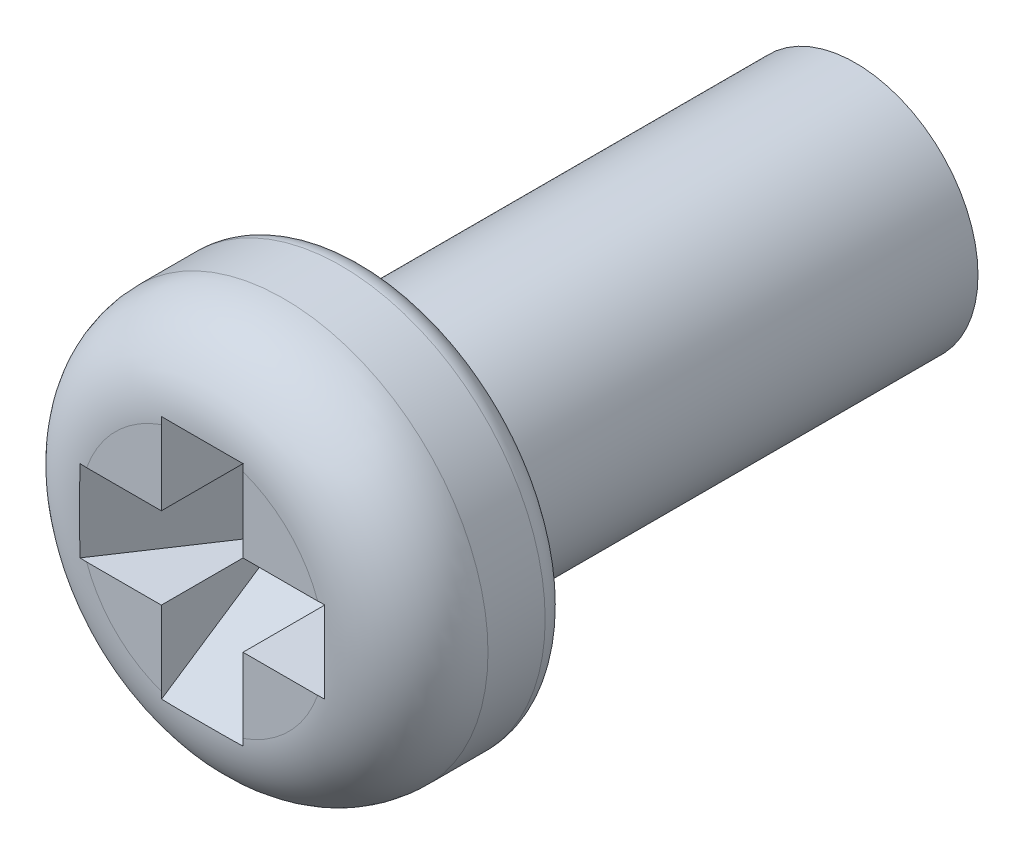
ISO-10303-21;
HEADER;
FILE_DESCRIPTION(('STEP AP214'),'2;1');
FILE_NAME('part.step','',(''),(''),'','','');
FILE_SCHEMA(('AUTOMOTIVE_DESIGN { 1 0 10303 214 1 1 1 1 }'));
ENDSEC;
DATA;
#1=APPLICATION_CONTEXT('core data for automotive mechanical design processes');
#2=APPLICATION_PROTOCOL_DEFINITION('international standard','automotive_design',2000,#1);
#3=PRODUCT_CONTEXT('',#1,'mechanical');
#4=PRODUCT('Part','Part','',(#3));
#5=PRODUCT_RELATED_PRODUCT_CATEGORY('part','',(#4));
#6=PRODUCT_DEFINITION_FORMATION('','',#4);
#7=PRODUCT_DEFINITION_CONTEXT('part definition',#1,'design');
#8=PRODUCT_DEFINITION('design','',#6,#7);
#9=PRODUCT_DEFINITION_SHAPE('','',#8);
#10=(LENGTH_UNIT() NAMED_UNIT(*) SI_UNIT(.MILLI.,.METRE.));
#11=(NAMED_UNIT(*) PLANE_ANGLE_UNIT() SI_UNIT($,.RADIAN.));
#12=(NAMED_UNIT(*) SI_UNIT($,.STERADIAN.) SOLID_ANGLE_UNIT());
#13=UNCERTAINTY_MEASURE_WITH_UNIT(LENGTH_MEASURE(1.E-05),#10,'distance_accuracy_value','');
#14=(GEOMETRIC_REPRESENTATION_CONTEXT(3) GLOBAL_UNCERTAINTY_ASSIGNED_CONTEXT((#13)) GLOBAL_UNIT_ASSIGNED_CONTEXT((#10,
#11,#12)) REPRESENTATION_CONTEXT('',''));
#15=CARTESIAN_POINT('',(0.,0.,0.));
#16=DIRECTION('',(0.,0.,1.));
#17=DIRECTION('',(1.,0.,0.));
#18=AXIS2_PLACEMENT_3D('',#15,#16,#17);
#19=CARTESIAN_POINT('',(0.,0.,5.));
#20=DIRECTION('',(0.,0.,1.));
#21=DIRECTION('',(1.,0.,0.));
#22=AXIS2_PLACEMENT_3D('',#19,#20,#21);
#23=PLANE('',#22);
#24=CARTESIAN_POINT('',(0.,0.,5.));
#25=DIRECTION('',(0.,0.,1.));
#26=DIRECTION('',(1.,0.,0.));
#27=AXIS2_PLACEMENT_3D('',#24,#25,#26);
#28=CIRCLE('',#27,1.5);
#29=CARTESIAN_POINT('',(-1.41421356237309,-0.5,5.));
#30=VERTEX_POINT('',#29);
#31=CARTESIAN_POINT('',(-0.500000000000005,-1.41421356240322,5.));
#32=VERTEX_POINT('',#31);
#33=EDGE_CURVE('E194',#30,#32,#28,.T.);
#34=ORIENTED_EDGE('',*,*,#33,.T.);
#35=DIRECTION('',(0.,-1.,0.));
#36=VECTOR('',#35,1.);
#37=CARTESIAN_POINT('',(-0.499999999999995,1.5,5.));
#38=LINE('',#37,#36);
#39=CARTESIAN_POINT('',(-0.500000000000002,-0.5,5.));
#40=VERTEX_POINT('',#39);
#41=EDGE_CURVE('E363',#40,#32,#38,.T.);
#42=ORIENTED_EDGE('',*,*,#41,.F.);
#43=DIRECTION('',(1.,0.,0.));
#44=VECTOR('',#43,1.);
#45=CARTESIAN_POINT('',(-1.5,-0.5,5.));
#46=LINE('',#45,#44);
#47=EDGE_CURVE('E155',#30,#40,#46,.T.);
#48=ORIENTED_EDGE('',*,*,#47,.F.);
#49=EDGE_LOOP('',(#34,#42,#48));
#50=FACE_BOUND('',#49,.T.);
#51=ADVANCED_FACE('F35',(#50),#23,.T.);
#52=CARTESIAN_POINT('',(0.,0.,4.));
#53=DIRECTION('',(0.,0.,1.));
#54=DIRECTION('',(1.,0.,0.));
#55=AXIS2_PLACEMENT_3D('',#52,#53,#54);
#56=TOROIDAL_SURFACE('',#55,1.5,1.);
#57=CARTESIAN_POINT('',(0.,0.,4.));
#58=DIRECTION('',(0.,0.,1.));
#59=DIRECTION('',(1.,0.,0.));
#60=AXIS2_PLACEMENT_3D('',#57,#58,#59);
#61=CIRCLE('',#60,2.5);
#62=CARTESIAN_POINT('',(2.5,0.,4.));
#63=VERTEX_POINT('',#62);
#64=EDGE_CURVE('E184',#63,#63,#61,.F.);
#65=ORIENTED_EDGE('',*,*,#64,.F.);
#66=EDGE_LOOP('',(#65));
#67=FACE_BOUND('',#66,.T.);
#68=CARTESIAN_POINT('',(-0.500200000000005,-1.49790504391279,4.99685756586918));
#69=CARTESIAN_POINT('',(-0.458525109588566,-1.49856638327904,4.99784957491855));
#70=CARTESIAN_POINT('',(-0.416843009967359,-1.49900857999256,4.99851286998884));
#71=CARTESIAN_POINT('',(-0.333474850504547,-1.49960856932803,4.99941285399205));
#72=CARTESIAN_POINT('',(-0.291788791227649,-1.49976638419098,4.99964957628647));
#73=CARTESIAN_POINT('',(-0.208419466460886,-1.49995154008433,4.99992731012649));
#74=CARTESIAN_POINT('',(-0.166736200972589,-1.49997888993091,4.99996833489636));
#75=CARTESIAN_POINT('',(-0.0833686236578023,-1.50000312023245,5.00000468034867));
#76=CARTESIAN_POINT('',(-0.0416843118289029,-1.50000000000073,5.00000000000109));
#77=CARTESIAN_POINT('',(0.0416843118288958,-1.50000000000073,5.00000000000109));
#78=CARTESIAN_POINT('',(0.0833686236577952,-1.50000312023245,5.00000468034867));
#79=CARTESIAN_POINT('',(0.166736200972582,-1.49997888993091,4.99996833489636));
#80=CARTESIAN_POINT('',(0.208419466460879,-1.49995154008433,4.99992731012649));
#81=CARTESIAN_POINT('',(0.291788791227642,-1.49976638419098,4.99964957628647));
#82=CARTESIAN_POINT('',(0.33347485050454,-1.49960856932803,4.99941285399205));
#83=CARTESIAN_POINT('',(0.416843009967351,-1.49900857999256,4.99851286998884));
#84=CARTESIAN_POINT('',(0.458525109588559,-1.49856638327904,4.99784957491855));
#85=CARTESIAN_POINT('',(0.500199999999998,-1.49790504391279,4.99685756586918));
#86=B_SPLINE_CURVE_WITH_KNOTS('',3,(#68,#69,#70,#71,#72,#73,#74,#75,#76,#77,#78,#79,#80,#81,#82,
#83,#84,#85),.UNSPECIFIED.,.F.,.F.,(4,2,2,2,2,2,2,2,4),(0.,0.125068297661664,0.250126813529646,
0.375176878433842,0.500229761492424,0.625282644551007,0.750332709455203,0.875391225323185,
1.00045952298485),.UNSPECIFIED.);
#87=CARTESIAN_POINT('',(-0.500000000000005,-1.49790823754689,4.99686235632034));
#88=VERTEX_POINT('',#87);
#89=CARTESIAN_POINT('',(0.499999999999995,-1.4979082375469,4.99686235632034));
#90=VERTEX_POINT('',#89);
#91=EDGE_CURVE('E143',#88,#90,#86,.T.);
#92=ORIENTED_EDGE('',*,*,#91,.F.);
#93=CARTESIAN_POINT('',(-0.5,0.,4.));
#94=CARTESIAN_POINT('',(-0.5,-6.36250101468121E-10,3.99999836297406));
#95=CARTESIAN_POINT('',(-0.5,-1.48902350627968E-07,3.99999672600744));
#96=CARTESIAN_POINT('',(-0.5,-6.78729285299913E-07,3.99999348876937));
#97=CARTESIAN_POINT('',(-0.5,-1.06101438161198E-06,3.99999188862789));
#98=CARTESIAN_POINT('',(-0.5,-2.49387769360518E-06,3.99998712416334));
#99=CARTESIAN_POINT('',(-0.5,-3.82720690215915E-06,3.99998404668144));
#100=CARTESIAN_POINT('',(-0.5,-7.03209990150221E-06,3.99997791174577));
#101=CARTESIAN_POINT('',(-0.5,-8.93616993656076E-06,3.99997487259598));
#102=CARTESIAN_POINT('',(-0.5,-1.30507217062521E-05,3.9999690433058));
#103=CARTESIAN_POINT('',(-0.5,-1.5259210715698E-05,3.99996625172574));
#104=CARTESIAN_POINT('',(-0.5,-2.30055624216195E-05,3.99995696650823));
#105=CARTESIAN_POINT('',(-0.5,-2.88749707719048E-05,3.99995076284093));
#106=CARTESIAN_POINT('',(-0.5,-4.06435459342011E-05,3.99993880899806));
#107=CARTESIAN_POINT('',(-0.5,-4.65339891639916E-05,3.99993305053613));
#108=CARTESIAN_POINT('',(-0.5,-7.91469605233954E-05,3.99989823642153));
#109=CARTESIAN_POINT('',(-0.5,-9.97412050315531E-05,3.99986400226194));
#110=CARTESIAN_POINT('',(-0.5,-0.000171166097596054,3.9997525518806));
#111=CARTESIAN_POINT('',(-0.5,-0.000225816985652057,3.9996786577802));
#112=CARTESIAN_POINT('',(-0.5,-0.000405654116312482,3.99943097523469));
#113=CARTESIAN_POINT('',(-0.5,-0.000528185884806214,3.99925477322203));
#114=CARTESIAN_POINT('',(-0.5,-0.00093874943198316,3.9986684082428));
#115=CARTESIAN_POINT('',(-0.5,-0.00122907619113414,3.99826033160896));
#116=CARTESIAN_POINT('',(-0.5,-0.00223146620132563,3.99684808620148));
#117=CARTESIAN_POINT('',(-0.5,-0.00294144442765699,3.99584202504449));
#118=CARTESIAN_POINT('',(-0.5,-0.0162318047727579,3.97701285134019));
#119=CARTESIAN_POINT('',(-0.5,-0.0288389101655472,3.95921337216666));
#120=CARTESIAN_POINT('',(-0.5,-0.0541572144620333,3.92356359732));
#121=CARTESIAN_POINT('',(-0.5,-0.066868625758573,3.90571344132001));
#122=CARTESIAN_POINT('',(-0.5,-0.104805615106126,3.85280611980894));
#123=CARTESIAN_POINT('',(-0.5,-0.130198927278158,3.81786891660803));
#124=CARTESIAN_POINT('',(-0.500000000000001,-0.182897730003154,3.74717723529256));
#125=CARTESIAN_POINT('',(-0.500000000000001,-0.210238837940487,3.71144905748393));
#126=CARTESIAN_POINT('',(-0.500000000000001,-0.266346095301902,3.64091720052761));
#127=CARTESIAN_POINT('',(-0.500000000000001,-0.295116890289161,3.60611718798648));
#128=CARTESIAN_POINT('',(-0.500000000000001,-0.350910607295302,3.54193824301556));
#129=CARTESIAN_POINT('',(-0.500000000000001,-0.377747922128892,3.51239939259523));
#130=CARTESIAN_POINT('',(-0.500000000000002,-0.432903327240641,3.45479978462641));
#131=CARTESIAN_POINT('',(-0.500000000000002,-0.461220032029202,3.42673769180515));
#132=CARTESIAN_POINT('',(-0.500000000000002,-0.548041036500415,3.34578992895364));
#133=CARTESIAN_POINT('',(-0.500000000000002,-0.609012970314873,3.29543356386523));
#134=CARTESIAN_POINT('',(-0.500000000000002,-0.701184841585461,3.23018261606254));
#135=CARTESIAN_POINT('',(-0.500000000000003,-0.729657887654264,3.21137341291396));
#136=CARTESIAN_POINT('',(-0.500000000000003,-0.787897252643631,3.17571700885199));
#137=CARTESIAN_POINT('',(-0.500000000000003,-0.817666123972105,3.15887394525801));
#138=CARTESIAN_POINT('',(-0.500000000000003,-0.879194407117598,3.12698415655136));
#139=CARTESIAN_POINT('',(-0.500000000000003,-0.9109859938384,3.11199917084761));
#140=CARTESIAN_POINT('',(-0.500000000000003,-0.975631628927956,3.08460930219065));
#141=CARTESIAN_POINT('',(-0.500000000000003,-1.00848502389,3.07220286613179));
#142=CARTESIAN_POINT('',(-0.500000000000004,-1.10822971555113,3.03922198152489));
#143=CARTESIAN_POINT('',(-0.500000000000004,-1.17654998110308,3.02275717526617));
#144=CARTESIAN_POINT('',(-0.500000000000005,-1.31447189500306,3.0023247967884));
#145=CARTESIAN_POINT('',(-0.500000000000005,-1.3840582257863,2.998254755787));
#146=CARTESIAN_POINT('',(-0.500000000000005,-1.51996862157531,3.00301759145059));
#147=CARTESIAN_POINT('',(-0.500000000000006,-1.58630979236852,3.01132998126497));
#148=CARTESIAN_POINT('',(-0.500000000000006,-1.71644512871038,3.04014308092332));
#149=CARTESIAN_POINT('',(-0.500000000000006,-1.78023484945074,3.0606641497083));
#150=CARTESIAN_POINT('',(-0.500000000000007,-1.89707505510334,3.11107137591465));
#151=CARTESIAN_POINT('',(-0.500000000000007,-1.95057363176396,3.13992223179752));
#152=CARTESIAN_POINT('',(-0.500000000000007,-2.05159308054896,3.20662450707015));
#153=CARTESIAN_POINT('',(-0.500000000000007,-2.09911887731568,3.24446843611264));
#154=CARTESIAN_POINT('',(-0.500000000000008,-2.18444814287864,3.32601260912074));
#155=CARTESIAN_POINT('',(-0.500000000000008,-2.22261475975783,3.36933339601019));
#156=CARTESIAN_POINT('',(-0.500000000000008,-2.29090177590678,3.46191708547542));
#157=CARTESIAN_POINT('',(-0.500000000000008,-2.32102280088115,3.51117952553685));
#158=CARTESIAN_POINT('',(-0.500000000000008,-2.37157032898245,3.61284203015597));
#159=CARTESIAN_POINT('',(-0.500000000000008,-2.39222951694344,3.66512652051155));
#160=CARTESIAN_POINT('',(-0.500000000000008,-2.42434839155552,3.77244790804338));
#161=CARTESIAN_POINT('',(-0.500000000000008,-2.43580895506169,3.82748454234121));
#162=CARTESIAN_POINT('',(-0.500000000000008,-2.44908753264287,3.93799297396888));
#163=CARTESIAN_POINT('',(-0.500000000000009,-2.45102687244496,3.99345022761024));
#164=CARTESIAN_POINT('',(-0.500000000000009,-2.44553316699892,4.10389729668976));
#165=CARTESIAN_POINT('',(-0.500000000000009,-2.43810045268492,4.15888712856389));
#166=CARTESIAN_POINT('',(-0.500000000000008,-2.41413074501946,4.26665098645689));
#167=CARTESIAN_POINT('',(-0.500000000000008,-2.39762411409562,4.31943177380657));
#168=CARTESIAN_POINT('',(-0.500000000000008,-2.35602728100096,4.42149261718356));
#169=CARTESIAN_POINT('',(-0.500000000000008,-2.3309370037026,4.47077264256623));
#170=CARTESIAN_POINT('',(-0.500000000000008,-2.2727747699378,4.56472058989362));
#171=CARTESIAN_POINT('',(-0.500000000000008,-2.23966255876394,4.60936357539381));
#172=CARTESIAN_POINT('',(-0.500000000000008,-2.16651214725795,4.69255296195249));
#173=CARTESIAN_POINT('',(-0.500000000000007,-2.126473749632,4.7310991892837));
#174=CARTESIAN_POINT('',(-0.500000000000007,-2.04001060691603,4.80163214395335));
#175=CARTESIAN_POINT('',(-0.500000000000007,-1.99350144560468,4.8335153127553));
#176=CARTESIAN_POINT('',(-0.500000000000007,-1.89590309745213,4.88925670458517));
#177=CARTESIAN_POINT('',(-0.500000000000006,-1.84481321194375,4.91311370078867));
#178=CARTESIAN_POINT('',(-0.500000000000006,-1.73803109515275,4.95287585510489));
#179=CARTESIAN_POINT('',(-0.500000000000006,-1.68225101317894,4.96854469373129));
#180=CARTESIAN_POINT('',(-0.500000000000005,-1.56892766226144,4.99074150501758));
#181=CARTESIAN_POINT('',(-0.500000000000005,-1.51138462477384,4.99727067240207));
#182=CARTESIAN_POINT('',(-0.500000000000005,-1.3932859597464,5.00143495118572));
#183=CARTESIAN_POINT('',(-0.500000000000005,-1.33271553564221,4.99863888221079));
#184=CARTESIAN_POINT('',(-0.500000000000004,-1.21269243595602,4.98369966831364));
#185=CARTESIAN_POINT('',(-0.500000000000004,-1.15324127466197,4.97154467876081));
#186=CARTESIAN_POINT('',(-0.500000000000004,-1.03190388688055,4.93730920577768));
#187=CARTESIAN_POINT('',(-0.500000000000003,-0.970229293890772,4.91448421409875));
#188=CARTESIAN_POINT('',(-0.500000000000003,-0.851094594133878,4.86020813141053));
#189=CARTESIAN_POINT('',(-0.500000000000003,-0.793621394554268,4.82878542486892));
#190=CARTESIAN_POINT('',(-0.500000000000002,-0.695766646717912,4.76670572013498));
#191=CARTESIAN_POINT('',(-0.500000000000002,-0.654458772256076,4.73748195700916));
#192=CARTESIAN_POINT('',(-0.500000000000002,-0.574616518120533,4.67543951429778));
#193=CARTESIAN_POINT('',(-0.500000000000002,-0.536083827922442,4.6426186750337));
#194=CARTESIAN_POINT('',(-0.500000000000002,-0.423472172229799,4.53882873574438));
#195=CARTESIAN_POINT('',(-0.500000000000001,-0.353570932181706,4.46332679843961));
#196=CARTESIAN_POINT('',(-0.500000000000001,-0.262060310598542,4.3537784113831));
#197=CARTESIAN_POINT('',(-0.500000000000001,-0.236944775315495,4.32245839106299));
#198=CARTESIAN_POINT('',(-0.500000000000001,-0.200379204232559,4.27543059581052));
#199=CARTESIAN_POINT('',(-0.500000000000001,-0.188567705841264,4.26000982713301));
#200=CARTESIAN_POINT('',(-0.5,-0.165164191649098,4.22906263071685));
#201=CARTESIAN_POINT('',(-0.5,-0.153571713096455,4.21353654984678));
#202=CARTESIAN_POINT('',(-0.5,-0.130915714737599,4.18287595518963));
#203=CARTESIAN_POINT('',(-0.5,-0.119847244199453,4.16774510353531));
#204=CARTESIAN_POINT('',(-0.5,-0.0977257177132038,4.13726959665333));
#205=CARTESIAN_POINT('',(-0.5,-0.0866736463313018,4.12192422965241));
#206=CARTESIAN_POINT('',(-0.5,-0.0633894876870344,4.08940908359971));
#207=CARTESIAN_POINT('',(-0.5,-0.0511675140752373,4.07223200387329));
#208=CARTESIAN_POINT('',(-0.5,-0.027173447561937,4.03843139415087));
#209=CARTESIAN_POINT('',(-0.5,-0.0154000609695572,4.02180869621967));
#210=CARTESIAN_POINT('',(-0.5,-0.0029429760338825,4.00416014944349));
#211=CARTESIAN_POINT('',(-0.5,-0.00223453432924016,4.00315625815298));
#212=CARTESIAN_POINT('',(-0.5,-0.00123274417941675,4.0017448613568));
#213=CARTESIAN_POINT('',(-0.5,-0.000941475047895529,4.00133546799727));
#214=CARTESIAN_POINT('',(-0.5,-0.000529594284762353,4.00074720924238));
#215=CARTESIAN_POINT('',(-0.5,-0.00040667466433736,4.00057044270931));
#216=CARTESIAN_POINT('',(-0.5,-0.000226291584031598,4.00032202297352));
#217=CARTESIAN_POINT('',(-0.5,-0.000171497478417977,4.00024794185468));
#218=CARTESIAN_POINT('',(-0.5,-9.99091309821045E-05,4.00013621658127));
#219=CARTESIAN_POINT('',(-0.5,-7.92771919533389E-05,4.00010191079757));
#220=CARTESIAN_POINT('',(-0.5,-4.65942147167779E-05,4.00006703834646));
#221=CARTESIAN_POINT('',(-0.5,-4.06934715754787E-05,4.00006127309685));
#222=CARTESIAN_POINT('',(-0.5,-2.89046788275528E-05,4.00004930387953));
#223=CARTESIAN_POINT('',(-0.5,-2.30254089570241E-05,4.00004309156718));
#224=CARTESIAN_POINT('',(-0.5,-1.52675007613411E-05,4.00003379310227));
#225=CARTESIAN_POINT('',(-0.5,-1.30562000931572E-05,4.00003099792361));
#226=CARTESIAN_POINT('',(-0.5,-8.93684187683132E-06,4.00002516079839));
#227=CARTESIAN_POINT('',(-0.5,-7.03078572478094E-06,4.00002211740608));
#228=CARTESIAN_POINT('',(-0.5,-3.82343657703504E-06,4.00001597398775));
#229=CARTESIAN_POINT('',(-0.5,-2.48951362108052E-06,4.00001289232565));
#230=CARTESIAN_POINT('',(-0.5,-1.05712370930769E-06,4.00000812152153));
#231=CARTESIAN_POINT('',(-0.5,-6.75217206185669E-07,4.00000651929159));
#232=CARTESIAN_POINT('',(-0.5,-1.46700832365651E-07,4.00000327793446));
#233=CARTESIAN_POINT('',(-0.5,6.36996542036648E-10,4.00000163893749));
#234=CARTESIAN_POINT('',(-0.5,0.,4.));
#235=B_SPLINE_CURVE_WITH_KNOTS('',3,(#93,#94,#95,#96,#97,#98,#99,#100,#101,#102,#103,#104,#105,
#106,#107,#108,#109,#110,#111,#112,#113,#114,#115,#116,#117,#118,#119,#120,#121,#122,#123,#124,
#125,#126,#127,#128,#129,#130,#131,#132,#133,#134,#135,#136,#137,#138,#139,#140,#141,#142,#143,
#144,#145,#146,#147,#148,#149,#150,#151,#152,#153,#154,#155,#156,#157,#158,#159,#160,#161,#162,
#163,#164,#165,#166,#167,#168,#169,#170,#171,#172,#173,#174,#175,#176,#177,#178,#179,#180,#181,
#182,#183,#184,#185,#186,#187,#188,#189,#190,#191,#192,#193,#194,#195,#196,#197,#198,#199,#200,
#201,#202,#203,#204,#205,#206,#207,#208,#209,#210,#211,#212,#213,#214,#215,#216,#217,#218,#219,
#220,#221,#222,#223,#224,#225,#226,#227,#228,#229,#230,#231,#232,#233,#234),.UNSPECIFIED.,.T.,
.F.,(4,2,2,2,2,2,2,2,2,2,2,2,2,2,2,2,2,2,2,2,2,2,2,2,2,2,2,2,2,2,2,2,2,2,2,2,2,2,2,2,2,2,2,2,2,
2,2,2,2,2,2,2,2,2,2,2,2,2,2,2,2,2,2,2,2,2,2,2,2,2,4),(0.,4.90754133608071E-06,
9.83034828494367E-06,1.98246640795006E-05,3.0557920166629E-05,4.12239869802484E-05,
6.68260554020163E-05,9.15038761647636E-05,0.000210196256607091,0.00048658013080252,
0.00112979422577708,0.00263276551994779,0.0063263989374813,0.0717670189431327,0.137506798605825,
0.267072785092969,0.402018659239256,0.537436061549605,0.657111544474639,0.77667688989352,
1.01304107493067,1.11535191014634,1.21787429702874,1.32320106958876,1.42846421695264,
1.63817133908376,1.84614001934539,2.04560996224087,2.24541347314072,2.42683471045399,
2.60810536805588,2.78046281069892,2.95280684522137,3.1206489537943,3.28847506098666,
3.45415696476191,3.61983301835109,3.78495804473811,3.95008451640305,4.11605742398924,
4.28203506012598,4.45042675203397,4.61884417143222,4.79188583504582,4.96490487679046,
5.14603282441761,5.32739038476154,5.52390226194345,5.71977304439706,5.87135751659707,
6.02303350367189,6.33062742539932,6.4510759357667,6.50934576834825,6.5674743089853,
6.62371474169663,6.68044788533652,6.74369080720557,6.80480465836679,6.80849031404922,
6.8099981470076,6.81064341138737,6.81092050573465,6.8110394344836,6.81106414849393,
6.81108978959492,6.81110046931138,6.8111112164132,6.81112122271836,6.8111261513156,
6.81113106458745),.UNSPECIFIED.);
#236=EDGE_CURVE('E332',#88,#32,#235,.T.);
#237=ORIENTED_EDGE('',*,*,#236,.T.);
#238=ORIENTED_EDGE('',*,*,#33,.F.);
#239=CARTESIAN_POINT('',(0.,-0.5,4.));
#240=CARTESIAN_POINT('',(-6.36246329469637E-10,-0.5,4.00000163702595));
#241=CARTESIAN_POINT('',(-1.48902340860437E-07,-0.5,4.00000327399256));
#242=CARTESIAN_POINT('',(-6.78729262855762E-07,-0.5,4.00000651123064));
#243=CARTESIAN_POINT('',(-1.06101435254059E-06,-0.5,4.00000811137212));
#244=CARTESIAN_POINT('',(-2.49387764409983E-06,-0.5,4.00001287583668));
#245=CARTESIAN_POINT('',(-3.82720683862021E-06,-0.5,4.00001595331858));
#246=CARTESIAN_POINT('',(-7.03209980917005E-06,-0.5,4.00002208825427));
#247=CARTESIAN_POINT('',(-8.93616982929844E-06,-0.5,4.00002512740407));
#248=CARTESIAN_POINT('',(-1.30507215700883E-05,-0.5,4.00003095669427));
#249=CARTESIAN_POINT('',(-1.52592105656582E-05,-0.5,4.00003374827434));
#250=CARTESIAN_POINT('',(-2.30055622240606E-05,-0.5,4.00004303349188));
#251=CARTESIAN_POINT('',(-2.88749705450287E-05,-0.5,4.0000492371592));
#252=CARTESIAN_POINT('',(-4.06435456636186E-05,-0.5,4.0000611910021));
#253=CARTESIAN_POINT('',(-4.6533988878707E-05,-0.5,4.00006694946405));
#254=CARTESIAN_POINT('',(-7.91469602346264E-05,-0.5,4.0001017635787));
#255=CARTESIAN_POINT('',(-9.97412049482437E-05,-0.5,4.00013599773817));
#256=CARTESIAN_POINT('',(-0.000171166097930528,-0.5,4.00024744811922));
#257=CARTESIAN_POINT('',(-0.000225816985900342,-0.5,4.00032134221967));
#258=CARTESIAN_POINT('',(-0.000405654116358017,-0.5,4.00056902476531));
#259=CARTESIAN_POINT('',(-0.000528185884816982,-0.5,4.00074522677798));
#260=CARTESIAN_POINT('',(-0.000938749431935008,-0.5,4.00133159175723));
#261=CARTESIAN_POINT('',(-0.00122907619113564,-0.5,4.00173966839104));
#262=CARTESIAN_POINT('',(-0.00223146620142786,-0.5,4.00315191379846));
#263=CARTESIAN_POINT('',(-0.00294144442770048,-0.5,4.00415797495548));
#264=CARTESIAN_POINT('',(-0.0162318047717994,-0.500000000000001,4.02298714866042));
#265=CARTESIAN_POINT('',(-0.028838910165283,-0.5,4.04078662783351));
#266=CARTESIAN_POINT('',(-0.0541572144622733,-0.5,4.07643640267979));
#267=CARTESIAN_POINT('',(-0.0668686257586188,-0.5,4.09428655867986));
#268=CARTESIAN_POINT('',(-0.104805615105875,-0.5,4.14719388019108));
#269=CARTESIAN_POINT('',(-0.130198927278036,-0.5,4.1821310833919));
#270=CARTESIAN_POINT('',(-0.182897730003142,-0.5,4.25282276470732));
#271=CARTESIAN_POINT('',(-0.210238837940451,-0.5,4.28855094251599));
#272=CARTESIAN_POINT('',(-0.266346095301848,-0.5,4.35908279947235));
#273=CARTESIAN_POINT('',(-0.295116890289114,-0.5,4.39388281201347));
#274=CARTESIAN_POINT('',(-0.350910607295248,-0.5,4.45806175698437));
#275=CARTESIAN_POINT('',(-0.377747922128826,-0.5,4.48760060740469));
#276=CARTESIAN_POINT('',(-0.432903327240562,-0.5,4.54520021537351));
#277=CARTESIAN_POINT('',(-0.461220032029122,-0.5,4.57326230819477));
#278=CARTESIAN_POINT('',(-0.54804103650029,-0.5,4.65421007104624));
#279=CARTESIAN_POINT('',(-0.609012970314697,-0.5,4.70456643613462));
#280=CARTESIAN_POINT('',(-0.701184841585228,-0.5,4.7698173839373));
#281=CARTESIAN_POINT('',(-0.729657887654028,-0.5,4.78862658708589));
#282=CARTESIAN_POINT('',(-0.787897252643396,-0.5,4.82428299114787));
#283=CARTESIAN_POINT('',(-0.817666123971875,-0.5,4.84112605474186));
#284=CARTESIAN_POINT('',(-0.879194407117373,-0.5,4.87301584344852));
#285=CARTESIAN_POINT('',(-0.910985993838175,-0.5,4.88800082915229));
#286=CARTESIAN_POINT('',(-0.975631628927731,-0.5,4.91539069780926));
#287=CARTESIAN_POINT('',(-1.00848502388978,-0.5,4.92779713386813));
#288=CARTESIAN_POINT('',(-1.1082297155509,-0.5,4.96077801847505));
#289=CARTESIAN_POINT('',(-1.17654998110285,-0.5,4.97724282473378));
#290=CARTESIAN_POINT('',(-1.31447189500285,-0.5,4.99767520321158));
#291=CARTESIAN_POINT('',(-1.3840582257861,-0.5,5.001745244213));
#292=CARTESIAN_POINT('',(-1.51996862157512,-0.5,4.99698240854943));
#293=CARTESIAN_POINT('',(-1.58630979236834,-0.5,4.98867001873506));
#294=CARTESIAN_POINT('',(-1.71644512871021,-0.5,4.95985691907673));
#295=CARTESIAN_POINT('',(-1.78023484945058,-0.5,4.93933585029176));
#296=CARTESIAN_POINT('',(-1.8970750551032,-0.5,4.88892862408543));
#297=CARTESIAN_POINT('',(-1.95057363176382,-0.5,4.86007776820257));
#298=CARTESIAN_POINT('',(-2.05159308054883,-0.5,4.79337549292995));
#299=CARTESIAN_POINT('',(-2.09911887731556,-0.5,4.75553156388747));
#300=CARTESIAN_POINT('',(-2.18444814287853,-0.5,4.67398739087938));
#301=CARTESIAN_POINT('',(-2.22261475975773,-0.5,4.63066660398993));
#302=CARTESIAN_POINT('',(-2.2909017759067,-0.5,4.53808291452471));
#303=CARTESIAN_POINT('',(-2.32102280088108,-0.5,4.48882047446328));
#304=CARTESIAN_POINT('',(-2.3715703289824,-0.5,4.38715796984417));
#305=CARTESIAN_POINT('',(-2.39222951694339,-0.5,4.33487347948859));
#306=CARTESIAN_POINT('',(-2.42434839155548,-0.5,4.22755209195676));
#307=CARTESIAN_POINT('',(-2.43580895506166,-0.5,4.17251545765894));
#308=CARTESIAN_POINT('',(-2.44908753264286,-0.5,4.06200702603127));
#309=CARTESIAN_POINT('',(-2.45102687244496,-0.5,4.00654977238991));
#310=CARTESIAN_POINT('',(-2.44553316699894,-0.5,3.89610270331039));
#311=CARTESIAN_POINT('',(-2.43810045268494,-0.5,3.84111287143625));
#312=CARTESIAN_POINT('',(-2.4141307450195,-0.5,3.73334901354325));
#313=CARTESIAN_POINT('',(-2.39762411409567,-0.5,3.68056822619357));
#314=CARTESIAN_POINT('',(-2.35602728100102,-0.5,3.57850738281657));
#315=CARTESIAN_POINT('',(-2.33093700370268,-0.5,3.5292273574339));
#316=CARTESIAN_POINT('',(-2.27277476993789,-0.5,3.4352794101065));
#317=CARTESIAN_POINT('',(-2.23966255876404,-0.5,3.3906364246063));
#318=CARTESIAN_POINT('',(-2.16651214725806,-0.5,3.30744703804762));
#319=CARTESIAN_POINT('',(-2.12647374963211,-0.5,3.2689008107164));
#320=CARTESIAN_POINT('',(-2.04001060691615,-0.5,3.19836785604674));
#321=CARTESIAN_POINT('',(-1.99350144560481,-0.5,3.16648468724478));
#322=CARTESIAN_POINT('',(-1.89590309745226,-0.5,3.1107432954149));
#323=CARTESIAN_POINT('',(-1.84481321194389,-0.5,3.08688629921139));
#324=CARTESIAN_POINT('',(-1.7380310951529,-0.5,3.04712414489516));
#325=CARTESIAN_POINT('',(-1.68225101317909,-0.5,3.03145530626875));
#326=CARTESIAN_POINT('',(-1.5689276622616,-0.5,3.00925849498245));
#327=CARTESIAN_POINT('',(-1.511384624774,-0.5,3.00272932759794));
#328=CARTESIAN_POINT('',(-1.39328595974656,-0.5,2.99856504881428));
#329=CARTESIAN_POINT('',(-1.33271553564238,-0.5,3.0013611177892));
#330=CARTESIAN_POINT('',(-1.21269243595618,-0.5,3.01630033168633));
#331=CARTESIAN_POINT('',(-1.15324127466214,-0.5,3.02845532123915));
#332=CARTESIAN_POINT('',(-1.03190388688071,-0.5,3.06269079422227));
#333=CARTESIAN_POINT('',(-0.970229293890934,-0.5,3.08551578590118));
#334=CARTESIAN_POINT('',(-0.851094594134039,-0.5,3.13979186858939));
#335=CARTESIAN_POINT('',(-0.793621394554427,-0.5,3.17121457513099));
#336=CARTESIAN_POINT('',(-0.695766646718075,-0.5,3.23329427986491));
#337=CARTESIAN_POINT('',(-0.654458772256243,-0.5,3.26251804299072));
#338=CARTESIAN_POINT('',(-0.574616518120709,-0.5,3.32456048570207));
#339=CARTESIAN_POINT('',(-0.536083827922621,-0.5,3.35738132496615));
#340=CARTESIAN_POINT('',(-0.423472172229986,-0.5,3.46117126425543));
#341=CARTESIAN_POINT('',(-0.353570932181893,-0.5,3.53667320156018));
#342=CARTESIAN_POINT('',(-0.262060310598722,-0.5,3.64622158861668));
#343=CARTESIAN_POINT('',(-0.236944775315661,-0.5,3.67754160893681));
#344=CARTESIAN_POINT('',(-0.200379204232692,-0.5,3.7245694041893));
#345=CARTESIAN_POINT('',(-0.188567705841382,-0.5,3.73999017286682));
#346=CARTESIAN_POINT('',(-0.165164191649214,-0.5,3.77093736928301));
#347=CARTESIAN_POINT('',(-0.153571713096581,-0.5,3.7864634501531));
#348=CARTESIAN_POINT('',(-0.130915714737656,-0.5,3.81712404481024));
#349=CARTESIAN_POINT('',(-0.119847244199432,-0.5,3.83225489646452));
#350=CARTESIAN_POINT('',(-0.0977257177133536,-0.5,3.86273040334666));
#351=CARTESIAN_POINT('',(-0.086673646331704,-0.5,3.87807577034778));
#352=CARTESIAN_POINT('',(-0.0633894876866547,-0.5,3.91059091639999));
#353=CARTESIAN_POINT('',(-0.0511675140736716,-0.5,3.92776799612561));
#354=CARTESIAN_POINT('',(-0.0271734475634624,-0.5,3.96156860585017));
#355=CARTESIAN_POINT('',(-0.0154000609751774,-0.5,3.97819130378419));
#356=CARTESIAN_POINT('',(-0.00294297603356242,-0.5,3.99583985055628));
#357=CARTESIAN_POINT('',(-0.00223453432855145,-0.5,3.99684374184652));
#358=CARTESIAN_POINT('',(-0.00123274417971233,-0.5,3.99825513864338));
#359=CARTESIAN_POINT('',(-0.000941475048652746,-0.5,3.99866453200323));
#360=CARTESIAN_POINT('',(-0.000529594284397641,-0.5,3.99925279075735));
#361=CARTESIAN_POINT('',(-0.000406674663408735,-0.5,3.99942955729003));
#362=CARTESIAN_POINT('',(-0.000226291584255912,-0.5,3.9996779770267));
#363=CARTESIAN_POINT('',(-0.000171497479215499,-0.5,3.99975205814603));
#364=CARTESIAN_POINT('',(-9.99091314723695E-05,-0.5,3.99986378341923));
#365=CARTESIAN_POINT('',(-7.92771922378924E-05,-0.5,3.99989808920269));
#366=CARTESIAN_POINT('',(-4.65942149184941E-05,-0.5,3.99993296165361));
#367=CARTESIAN_POINT('',(-4.06934717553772E-05,-0.5,3.9999387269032));
#368=CARTESIAN_POINT('',(-2.89046789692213E-05,-0.5,3.9999506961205));
#369=CARTESIAN_POINT('',(-2.30254090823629E-05,-0.5,3.99995690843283));
#370=CARTESIAN_POINT('',(-1.52675008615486E-05,-0.5,3.99996620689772));
#371=CARTESIAN_POINT('',(-1.30562001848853E-05,-0.5,3.99996900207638));
#372=CARTESIAN_POINT('',(-8.93684195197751E-06,-0.5,3.9999748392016));
#373=CARTESIAN_POINT('',(-7.03078579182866E-06,-0.5,3.99997788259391));
#374=CARTESIAN_POINT('',(-3.82343662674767E-06,-0.5,3.99998402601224));
#375=CARTESIAN_POINT('',(-2.48951366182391E-06,-0.5,3.99998710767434));
#376=CARTESIAN_POINT('',(-1.05712373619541E-06,-0.5,3.99999187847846));
#377=CARTESIAN_POINT('',(-6.75217228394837E-07,-0.5,3.99999348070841));
#378=CARTESIAN_POINT('',(-1.46700844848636E-07,-0.5,3.99999672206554));
#379=CARTESIAN_POINT('',(6.36989272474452E-10,-0.5,3.9999983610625));
#380=CARTESIAN_POINT('',(0.,-0.5,4.));
#381=B_SPLINE_CURVE_WITH_KNOTS('',3,(#239,#240,#241,#242,#243,#244,#245,#246,#247,#248,#249,
#250,#251,#252,#253,#254,#255,#256,#257,#258,#259,#260,#261,#262,#263,#264,#265,#266,#267,#268,
#269,#270,#271,#272,#273,#274,#275,#276,#277,#278,#279,#280,#281,#282,#283,#284,#285,#286,#287,
#288,#289,#290,#291,#292,#293,#294,#295,#296,#297,#298,#299,#300,#301,#302,#303,#304,#305,#306,
#307,#308,#309,#310,#311,#312,#313,#314,#315,#316,#317,#318,#319,#320,#321,#322,#323,#324,#325,
#326,#327,#328,#329,#330,#331,#332,#333,#334,#335,#336,#337,#338,#339,#340,#341,#342,#343,#344,
#345,#346,#347,#348,#349,#350,#351,#352,#353,#354,#355,#356,#357,#358,#359,#360,#361,#362,#363,
#364,#365,#366,#367,#368,#369,#370,#371,#372,#373,#374,#375,#376,#377,#378,#379,#380),
.UNSPECIFIED.,.T.,.F.,(4,2,2,2,2,2,2,2,2,2,2,2,2,2,2,2,2,2,2,2,2,2,2,2,2,2,2,2,2,2,2,2,2,2,2,2,
2,2,2,2,2,2,2,2,2,2,2,2,2,2,2,2,2,2,2,2,2,2,2,2,2,2,2,2,2,2,2,2,2,2,4),(0.,4.90754133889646E-06,
9.83034829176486E-06,1.98246640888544E-05,3.0557920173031E-05,4.12239869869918E-05,
6.68260553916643E-05,9.15038761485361E-05,0.000210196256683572,0.000486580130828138,
0.00112979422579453,0.00263276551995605,0.00632639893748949,0.0717670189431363,
0.137506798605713,0.267072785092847,0.402018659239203,0.537436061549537,0.657111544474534,
0.776676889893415,1.0130410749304,1.11535191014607,1.21787429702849,1.32320106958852,
1.42846421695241,1.63817133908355,1.8461400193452,2.0456099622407,2.24541347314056,
2.42683471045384,2.60810536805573,2.78046281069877,2.95280684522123,3.12064895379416,
3.28847506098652,3.45415696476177,3.61983301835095,3.78495804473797,3.95008451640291,
4.1160574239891,4.28203506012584,4.45042675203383,4.61884417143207,4.79188583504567,
4.96490487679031,5.14603282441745,5.32739038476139,5.52390226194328,5.71977304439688,
5.87135751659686,6.02303350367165,6.33062742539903,6.45107593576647,6.50934576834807,
6.56747430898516,6.62371474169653,6.68044788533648,6.74369080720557,6.80480465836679,
6.8084903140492,6.8099981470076,6.81064341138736,6.81092050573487,6.81103943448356,
6.8110641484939,6.81108978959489,6.81110046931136,6.81111121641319,6.81112122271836,
6.81112615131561,6.81113106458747),.UNSPECIFIED.);
#382=CARTESIAN_POINT('',(-1.49790823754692,-0.5,4.99686235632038));
#383=VERTEX_POINT('',#382);
#384=EDGE_CURVE('E235',#30,#383,#381,.T.);
#385=ORIENTED_EDGE('',*,*,#384,.T.);
#386=CARTESIAN_POINT('',(-1.49790504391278,0.5002,4.99685756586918));
#387=CARTESIAN_POINT('',(-1.49856638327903,0.458525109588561,4.99784957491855));
#388=CARTESIAN_POINT('',(-1.49900857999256,0.416843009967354,4.99851286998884));
#389=CARTESIAN_POINT('',(-1.49960856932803,0.333474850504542,4.99941285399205));
#390=CARTESIAN_POINT('',(-1.49976638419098,0.291788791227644,4.99964957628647));
#391=CARTESIAN_POINT('',(-1.49995154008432,0.208419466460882,4.99992731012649));
#392=CARTESIAN_POINT('',(-1.4999788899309,0.166736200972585,4.99996833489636));
#393=CARTESIAN_POINT('',(-1.50000312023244,0.0833686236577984,5.00000468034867));
#394=CARTESIAN_POINT('',(-1.50000000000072,0.0416843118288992,5.00000000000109));
#395=CARTESIAN_POINT('',(-1.50000000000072,-0.0416843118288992,5.00000000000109));
#396=CARTESIAN_POINT('',(-1.50000312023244,-0.0833686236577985,5.00000468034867));
#397=CARTESIAN_POINT('',(-1.4999788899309,-0.166736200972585,4.99996833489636));
#398=CARTESIAN_POINT('',(-1.49995154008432,-0.208419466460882,4.99992731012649));
#399=CARTESIAN_POINT('',(-1.49976638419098,-0.291788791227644,4.99964957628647));
#400=CARTESIAN_POINT('',(-1.49960856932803,-0.333474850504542,4.99941285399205));
#401=CARTESIAN_POINT('',(-1.49900857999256,-0.416843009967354,4.99851286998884));
#402=CARTESIAN_POINT('',(-1.49856638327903,-0.458525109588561,4.99784957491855));
#403=CARTESIAN_POINT('',(-1.49790504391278,-0.5002,4.99685756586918));
#404=B_SPLINE_CURVE_WITH_KNOTS('',3,(#386,#387,#388,#389,#390,#391,#392,#393,#394,#395,#396,
#397,#398,#399,#400,#401,#402,#403),.UNSPECIFIED.,.F.,.F.,(4,2,2,2,2,2,2,2,4),(0.,
0.125068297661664,0.250126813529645,0.375176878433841,0.500229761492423,0.625282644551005,
0.7503327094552,0.875391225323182,1.00045952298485),.UNSPECIFIED.);
#405=CARTESIAN_POINT('',(-1.49790823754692,0.5,4.99686235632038));
#406=VERTEX_POINT('',#405);
#407=EDGE_CURVE('E205',#406,#383,#404,.T.);
#408=ORIENTED_EDGE('',*,*,#407,.F.);
#409=CARTESIAN_POINT('',(0.,0.5,4.));
#410=CARTESIAN_POINT('',(-6.36246329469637E-10,0.5,4.00000163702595));
#411=CARTESIAN_POINT('',(-1.48902340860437E-07,0.5,4.00000327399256));
#412=CARTESIAN_POINT('',(-6.78729262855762E-07,0.5,4.00000651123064));
#413=CARTESIAN_POINT('',(-1.06101435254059E-06,0.5,4.00000811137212));
#414=CARTESIAN_POINT('',(-2.49387764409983E-06,0.5,4.00001287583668));
#415=CARTESIAN_POINT('',(-3.82720683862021E-06,0.5,4.00001595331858));
#416=CARTESIAN_POINT('',(-7.03209980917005E-06,0.5,4.00002208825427));
#417=CARTESIAN_POINT('',(-8.93616982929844E-06,0.5,4.00002512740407));
#418=CARTESIAN_POINT('',(-1.30507215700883E-05,0.5,4.00003095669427));
#419=CARTESIAN_POINT('',(-1.52592105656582E-05,0.5,4.00003374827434));
#420=CARTESIAN_POINT('',(-2.30055622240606E-05,0.5,4.00004303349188));
#421=CARTESIAN_POINT('',(-2.88749705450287E-05,0.5,4.0000492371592));
#422=CARTESIAN_POINT('',(-4.06435456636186E-05,0.5,4.0000611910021));
#423=CARTESIAN_POINT('',(-4.6533988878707E-05,0.5,4.00006694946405));
#424=CARTESIAN_POINT('',(-7.91469602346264E-05,0.5,4.0001017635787));
#425=CARTESIAN_POINT('',(-9.97412049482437E-05,0.5,4.00013599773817));
#426=CARTESIAN_POINT('',(-0.000171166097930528,0.5,4.00024744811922));
#427=CARTESIAN_POINT('',(-0.000225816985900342,0.5,4.00032134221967));
#428=CARTESIAN_POINT('',(-0.000405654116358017,0.5,4.00056902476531));
#429=CARTESIAN_POINT('',(-0.000528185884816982,0.5,4.00074522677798));
#430=CARTESIAN_POINT('',(-0.000938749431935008,0.5,4.00133159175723));
#431=CARTESIAN_POINT('',(-0.00122907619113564,0.5,4.00173966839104));
#432=CARTESIAN_POINT('',(-0.00223146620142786,0.5,4.00315191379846));
#433=CARTESIAN_POINT('',(-0.00294144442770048,0.5,4.00415797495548));
#434=CARTESIAN_POINT('',(-0.0162318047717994,0.500000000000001,4.02298714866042));
#435=CARTESIAN_POINT('',(-0.028838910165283,0.5,4.04078662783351));
#436=CARTESIAN_POINT('',(-0.0541572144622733,0.5,4.07643640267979));
#437=CARTESIAN_POINT('',(-0.0668686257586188,0.5,4.09428655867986));
#438=CARTESIAN_POINT('',(-0.104805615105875,0.5,4.14719388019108));
#439=CARTESIAN_POINT('',(-0.130198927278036,0.5,4.1821310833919));
#440=CARTESIAN_POINT('',(-0.182897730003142,0.5,4.25282276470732));
#441=CARTESIAN_POINT('',(-0.210238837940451,0.5,4.28855094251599));
#442=CARTESIAN_POINT('',(-0.266346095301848,0.5,4.35908279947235));
#443=CARTESIAN_POINT('',(-0.295116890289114,0.5,4.39388281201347));
#444=CARTESIAN_POINT('',(-0.350910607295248,0.5,4.45806175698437));
#445=CARTESIAN_POINT('',(-0.377747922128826,0.5,4.48760060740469));
#446=CARTESIAN_POINT('',(-0.432903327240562,0.5,4.54520021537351));
#447=CARTESIAN_POINT('',(-0.461220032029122,0.5,4.57326230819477));
#448=CARTESIAN_POINT('',(-0.54804103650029,0.5,4.65421007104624));
#449=CARTESIAN_POINT('',(-0.609012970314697,0.5,4.70456643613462));
#450=CARTESIAN_POINT('',(-0.701184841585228,0.5,4.7698173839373));
#451=CARTESIAN_POINT('',(-0.729657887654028,0.5,4.78862658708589));
#452=CARTESIAN_POINT('',(-0.787897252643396,0.5,4.82428299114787));
#453=CARTESIAN_POINT('',(-0.817666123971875,0.5,4.84112605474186));
#454=CARTESIAN_POINT('',(-0.879194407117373,0.5,4.87301584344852));
#455=CARTESIAN_POINT('',(-0.910985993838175,0.5,4.88800082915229));
#456=CARTESIAN_POINT('',(-0.975631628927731,0.5,4.91539069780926));
#457=CARTESIAN_POINT('',(-1.00848502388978,0.5,4.92779713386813));
#458=CARTESIAN_POINT('',(-1.1082297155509,0.5,4.96077801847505));
#459=CARTESIAN_POINT('',(-1.17654998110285,0.5,4.97724282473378));
#460=CARTESIAN_POINT('',(-1.31447189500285,0.5,4.99767520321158));
#461=CARTESIAN_POINT('',(-1.3840582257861,0.5,5.001745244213));
#462=CARTESIAN_POINT('',(-1.51996862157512,0.5,4.99698240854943));
#463=CARTESIAN_POINT('',(-1.58630979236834,0.5,4.98867001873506));
#464=CARTESIAN_POINT('',(-1.71644512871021,0.5,4.95985691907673));
#465=CARTESIAN_POINT('',(-1.78023484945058,0.5,4.93933585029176));
#466=CARTESIAN_POINT('',(-1.8970750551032,0.5,4.88892862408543));
#467=CARTESIAN_POINT('',(-1.95057363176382,0.5,4.86007776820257));
#468=CARTESIAN_POINT('',(-2.05159308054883,0.5,4.79337549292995));
#469=CARTESIAN_POINT('',(-2.09911887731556,0.5,4.75553156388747));
#470=CARTESIAN_POINT('',(-2.18444814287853,0.5,4.67398739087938));
#471=CARTESIAN_POINT('',(-2.22261475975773,0.5,4.63066660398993));
#472=CARTESIAN_POINT('',(-2.2909017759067,0.5,4.53808291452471));
#473=CARTESIAN_POINT('',(-2.32102280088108,0.5,4.48882047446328));
#474=CARTESIAN_POINT('',(-2.3715703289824,0.5,4.38715796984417));
#475=CARTESIAN_POINT('',(-2.39222951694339,0.5,4.33487347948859));
#476=CARTESIAN_POINT('',(-2.42434839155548,0.5,4.22755209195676));
#477=CARTESIAN_POINT('',(-2.43580895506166,0.5,4.17251545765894));
#478=CARTESIAN_POINT('',(-2.44908753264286,0.5,4.06200702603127));
#479=CARTESIAN_POINT('',(-2.45102687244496,0.5,4.00654977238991));
#480=CARTESIAN_POINT('',(-2.44553316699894,0.5,3.89610270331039));
#481=CARTESIAN_POINT('',(-2.43810045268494,0.5,3.84111287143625));
#482=CARTESIAN_POINT('',(-2.4141307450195,0.5,3.73334901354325));
#483=CARTESIAN_POINT('',(-2.39762411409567,0.5,3.68056822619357));
#484=CARTESIAN_POINT('',(-2.35602728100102,0.5,3.57850738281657));
#485=CARTESIAN_POINT('',(-2.33093700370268,0.5,3.5292273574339));
#486=CARTESIAN_POINT('',(-2.27277476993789,0.5,3.4352794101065));
#487=CARTESIAN_POINT('',(-2.23966255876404,0.5,3.3906364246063));
#488=CARTESIAN_POINT('',(-2.16651214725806,0.5,3.30744703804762));
#489=CARTESIAN_POINT('',(-2.12647374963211,0.5,3.2689008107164));
#490=CARTESIAN_POINT('',(-2.04001060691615,0.5,3.19836785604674));
#491=CARTESIAN_POINT('',(-1.99350144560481,0.5,3.16648468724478));
#492=CARTESIAN_POINT('',(-1.89590309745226,0.5,3.1107432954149));
#493=CARTESIAN_POINT('',(-1.84481321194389,0.5,3.08688629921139));
#494=CARTESIAN_POINT('',(-1.7380310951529,0.5,3.04712414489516));
#495=CARTESIAN_POINT('',(-1.68225101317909,0.5,3.03145530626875));
#496=CARTESIAN_POINT('',(-1.5689276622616,0.5,3.00925849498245));
#497=CARTESIAN_POINT('',(-1.511384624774,0.5,3.00272932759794));
#498=CARTESIAN_POINT('',(-1.39328595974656,0.5,2.99856504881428));
#499=CARTESIAN_POINT('',(-1.33271553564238,0.5,3.0013611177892));
#500=CARTESIAN_POINT('',(-1.21269243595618,0.5,3.01630033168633));
#501=CARTESIAN_POINT('',(-1.15324127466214,0.5,3.02845532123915));
#502=CARTESIAN_POINT('',(-1.03190388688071,0.5,3.06269079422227));
#503=CARTESIAN_POINT('',(-0.970229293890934,0.5,3.08551578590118));
#504=CARTESIAN_POINT('',(-0.851094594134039,0.5,3.13979186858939));
#505=CARTESIAN_POINT('',(-0.793621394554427,0.5,3.17121457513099));
#506=CARTESIAN_POINT('',(-0.695766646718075,0.5,3.23329427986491));
#507=CARTESIAN_POINT('',(-0.654458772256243,0.5,3.26251804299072));
#508=CARTESIAN_POINT('',(-0.574616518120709,0.5,3.32456048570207));
#509=CARTESIAN_POINT('',(-0.536083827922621,0.5,3.35738132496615));
#510=CARTESIAN_POINT('',(-0.423472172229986,0.5,3.46117126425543));
#511=CARTESIAN_POINT('',(-0.353570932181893,0.5,3.53667320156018));
#512=CARTESIAN_POINT('',(-0.262060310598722,0.5,3.64622158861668));
#513=CARTESIAN_POINT('',(-0.236944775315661,0.5,3.67754160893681));
#514=CARTESIAN_POINT('',(-0.200379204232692,0.5,3.7245694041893));
#515=CARTESIAN_POINT('',(-0.188567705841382,0.5,3.73999017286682));
#516=CARTESIAN_POINT('',(-0.165164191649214,0.5,3.77093736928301));
#517=CARTESIAN_POINT('',(-0.153571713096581,0.5,3.7864634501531));
#518=CARTESIAN_POINT('',(-0.130915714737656,0.5,3.81712404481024));
#519=CARTESIAN_POINT('',(-0.119847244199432,0.5,3.83225489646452));
#520=CARTESIAN_POINT('',(-0.0977257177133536,0.5,3.86273040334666));
#521=CARTESIAN_POINT('',(-0.086673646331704,0.5,3.87807577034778));
#522=CARTESIAN_POINT('',(-0.0633894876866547,0.5,3.91059091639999));
#523=CARTESIAN_POINT('',(-0.0511675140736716,0.5,3.92776799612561));
#524=CARTESIAN_POINT('',(-0.0271734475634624,0.5,3.96156860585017));
#525=CARTESIAN_POINT('',(-0.0154000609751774,0.5,3.97819130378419));
#526=CARTESIAN_POINT('',(-0.00294297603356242,0.5,3.99583985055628));
#527=CARTESIAN_POINT('',(-0.00223453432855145,0.5,3.99684374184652));
#528=CARTESIAN_POINT('',(-0.00123274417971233,0.5,3.99825513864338));
#529=CARTESIAN_POINT('',(-0.000941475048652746,0.5,3.99866453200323));
#530=CARTESIAN_POINT('',(-0.000529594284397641,0.5,3.99925279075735));
#531=CARTESIAN_POINT('',(-0.000406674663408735,0.5,3.99942955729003));
#532=CARTESIAN_POINT('',(-0.000226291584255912,0.5,3.9996779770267));
#533=CARTESIAN_POINT('',(-0.000171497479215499,0.5,3.99975205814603));
#534=CARTESIAN_POINT('',(-9.99091314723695E-05,0.5,3.99986378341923));
#535=CARTESIAN_POINT('',(-7.92771922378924E-05,0.5,3.99989808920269));
#536=CARTESIAN_POINT('',(-4.65942149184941E-05,0.5,3.99993296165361));
#537=CARTESIAN_POINT('',(-4.06934717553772E-05,0.5,3.9999387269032));
#538=CARTESIAN_POINT('',(-2.89046789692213E-05,0.5,3.9999506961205));
#539=CARTESIAN_POINT('',(-2.30254090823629E-05,0.5,3.99995690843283));
#540=CARTESIAN_POINT('',(-1.52675008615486E-05,0.5,3.99996620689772));
#541=CARTESIAN_POINT('',(-1.30562001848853E-05,0.5,3.99996900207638));
#542=CARTESIAN_POINT('',(-8.93684195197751E-06,0.5,3.9999748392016));
#543=CARTESIAN_POINT('',(-7.03078579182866E-06,0.5,3.99997788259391));
#544=CARTESIAN_POINT('',(-3.82343662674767E-06,0.5,3.99998402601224));
#545=CARTESIAN_POINT('',(-2.48951366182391E-06,0.5,3.99998710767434));
#546=CARTESIAN_POINT('',(-1.05712373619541E-06,0.5,3.99999187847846));
#547=CARTESIAN_POINT('',(-6.75217228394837E-07,0.5,3.99999348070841));
#548=CARTESIAN_POINT('',(-1.46700844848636E-07,0.5,3.99999672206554));
#549=CARTESIAN_POINT('',(6.36989272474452E-10,0.5,3.9999983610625));
#550=CARTESIAN_POINT('',(0.,0.5,4.));
#551=B_SPLINE_CURVE_WITH_KNOTS('',3,(#409,#410,#411,#412,#413,#414,#415,#416,#417,#418,#419,
#420,#421,#422,#423,#424,#425,#426,#427,#428,#429,#430,#431,#432,#433,#434,#435,#436,#437,#438,
#439,#440,#441,#442,#443,#444,#445,#446,#447,#448,#449,#450,#451,#452,#453,#454,#455,#456,#457,
#458,#459,#460,#461,#462,#463,#464,#465,#466,#467,#468,#469,#470,#471,#472,#473,#474,#475,#476,
#477,#478,#479,#480,#481,#482,#483,#484,#485,#486,#487,#488,#489,#490,#491,#492,#493,#494,#495,
#496,#497,#498,#499,#500,#501,#502,#503,#504,#505,#506,#507,#508,#509,#510,#511,#512,#513,#514,
#515,#516,#517,#518,#519,#520,#521,#522,#523,#524,#525,#526,#527,#528,#529,#530,#531,#532,#533,
#534,#535,#536,#537,#538,#539,#540,#541,#542,#543,#544,#545,#546,#547,#548,#549,#550),
.UNSPECIFIED.,.T.,.F.,(4,2,2,2,2,2,2,2,2,2,2,2,2,2,2,2,2,2,2,2,2,2,2,2,2,2,2,2,2,2,2,2,2,2,2,2,
2,2,2,2,2,2,2,2,2,2,2,2,2,2,2,2,2,2,2,2,2,2,2,2,2,2,2,2,2,2,2,2,2,2,4),(0.,4.90754133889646E-06,
9.83034829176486E-06,1.98246640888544E-05,3.0557920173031E-05,4.12239869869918E-05,
6.68260553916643E-05,9.15038761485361E-05,0.000210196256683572,0.000486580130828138,
0.00112979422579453,0.00263276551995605,0.00632639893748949,0.0717670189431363,
0.137506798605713,0.267072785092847,0.402018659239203,0.537436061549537,0.657111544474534,
0.776676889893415,1.0130410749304,1.11535191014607,1.21787429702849,1.32320106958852,
1.42846421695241,1.63817133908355,1.8461400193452,2.0456099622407,2.24541347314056,
2.42683471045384,2.60810536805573,2.78046281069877,2.95280684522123,3.12064895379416,
3.28847506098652,3.45415696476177,3.61983301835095,3.78495804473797,3.95008451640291,
4.1160574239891,4.28203506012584,4.45042675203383,4.61884417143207,4.79188583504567,
4.96490487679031,5.14603282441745,5.32739038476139,5.52390226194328,5.71977304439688,
5.87135751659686,6.02303350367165,6.33062742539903,6.45107593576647,6.50934576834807,
6.56747430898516,6.62371474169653,6.68044788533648,6.74369080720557,6.80480465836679,
6.8084903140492,6.8099981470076,6.81064341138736,6.81092050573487,6.81103943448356,
6.8110641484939,6.81108978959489,6.81110046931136,6.81111121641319,6.81112122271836,
6.81112615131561,6.81113106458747),.UNSPECIFIED.);
#552=CARTESIAN_POINT('',(-1.41421356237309,0.500000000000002,5.));
#553=VERTEX_POINT('',#552);
#554=EDGE_CURVE('E198',#553,#406,#551,.T.);
#555=ORIENTED_EDGE('',*,*,#554,.F.);
#556=CARTESIAN_POINT('',(-0.499999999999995,1.4142135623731,5.));
#557=VERTEX_POINT('',#556);
#558=EDGE_CURVE('E58',#557,#553,#28,.T.);
#559=ORIENTED_EDGE('',*,*,#558,.F.);
#560=CARTESIAN_POINT('',(-0.5,0.,4.));
#561=CARTESIAN_POINT('',(-0.5,6.36253642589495E-10,4.00000163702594));
#562=CARTESIAN_POINT('',(-0.5,1.48902354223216E-07,4.00000327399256));
#563=CARTESIAN_POINT('',(-0.5,6.78729289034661E-07,4.00000651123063));
#564=CARTESIAN_POINT('',(-0.5,1.06101438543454E-06,4.00000811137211));
#565=CARTESIAN_POINT('',(-0.5,2.49387769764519E-06,4.00001287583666));
#566=CARTESIAN_POINT('',(-0.5,3.82720690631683E-06,4.00001595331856));
#567=CARTESIAN_POINT('',(-0.5,7.03209990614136E-06,4.00002208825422));
#568=CARTESIAN_POINT('',(-0.5,8.9361699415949E-06,4.00002512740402));
#569=CARTESIAN_POINT('',(-0.5,1.30507217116E-05,4.00003095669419));
#570=CARTESIAN_POINT('',(-0.5,1.52592107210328E-05,4.00003374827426));
#571=CARTESIAN_POINT('',(-0.5,2.30055624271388E-05,4.00004303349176));
#572=CARTESIAN_POINT('',(-0.5,2.88749707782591E-05,4.00004923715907));
#573=CARTESIAN_POINT('',(-0.5,4.06435459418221E-05,4.00006119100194));
#574=CARTESIAN_POINT('',(-0.5,4.65339891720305E-05,4.00006694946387));
#575=CARTESIAN_POINT('',(-0.5,7.91469605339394E-05,4.00010176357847));
#576=CARTESIAN_POINT('',(-0.5,9.97412050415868E-05,4.00013599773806));
#577=CARTESIAN_POINT('',(-0.5,0.000171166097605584,4.0002474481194));
#578=CARTESIAN_POINT('',(-0.5,0.000225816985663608,4.0003213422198));
#579=CARTESIAN_POINT('',(-0.5,0.000405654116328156,4.0005690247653));
#580=CARTESIAN_POINT('',(-0.5,0.000528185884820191,4.00074522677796));
#581=CARTESIAN_POINT('',(-0.5,0.000938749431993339,4.00133159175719));
#582=CARTESIAN_POINT('',(-0.5,0.00122907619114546,4.00173966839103));
#583=CARTESIAN_POINT('',(-0.5,0.00223146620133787,4.00315191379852));
#584=CARTESIAN_POINT('',(-0.5,0.00294144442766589,4.0041579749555));
#585=CARTESIAN_POINT('',(-0.5,0.016231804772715,4.02298714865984));
#586=CARTESIAN_POINT('',(-0.5,0.0288389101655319,4.04078662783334));
#587=CARTESIAN_POINT('',(-0.5,0.0541572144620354,4.07643640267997));
#588=CARTESIAN_POINT('',(-0.5,0.0668686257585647,4.09428655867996));
#589=CARTESIAN_POINT('',(-0.5,0.104805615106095,4.14719388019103));
#590=CARTESIAN_POINT('',(-0.5,0.130198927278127,4.18213108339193));
#591=CARTESIAN_POINT('',(-0.499999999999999,0.182897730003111,4.25282276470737));
#592=CARTESIAN_POINT('',(-0.499999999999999,0.210238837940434,4.28855094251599));
#593=CARTESIAN_POINT('',(-0.499999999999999,0.26634609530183,4.3590827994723));
#594=CARTESIAN_POINT('',(-0.499999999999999,0.295116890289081,4.39388281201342));
#595=CARTESIAN_POINT('',(-0.499999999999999,0.350910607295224,4.45806175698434));
#596=CARTESIAN_POINT('',(-0.499999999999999,0.377747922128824,4.48760060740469));
#597=CARTESIAN_POINT('',(-0.499999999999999,0.432903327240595,4.54520021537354));
#598=CARTESIAN_POINT('',(-0.499999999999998,0.461220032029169,4.57326230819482));
#599=CARTESIAN_POINT('',(-0.499999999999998,0.548041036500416,4.65421007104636));
#600=CARTESIAN_POINT('',(-0.499999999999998,0.609012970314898,4.70456643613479));
#601=CARTESIAN_POINT('',(-0.499999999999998,0.701184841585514,4.76981738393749));
#602=CARTESIAN_POINT('',(-0.499999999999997,0.729657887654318,4.78862658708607));
#603=CARTESIAN_POINT('',(-0.499999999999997,0.787897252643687,4.82428299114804));
#604=CARTESIAN_POINT('',(-0.499999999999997,0.817666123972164,4.84112605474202));
#605=CARTESIAN_POINT('',(-0.499999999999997,0.879194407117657,4.87301584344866));
#606=CARTESIAN_POINT('',(-0.499999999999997,0.910985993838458,4.88800082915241));
#607=CARTESIAN_POINT('',(-0.499999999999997,0.975631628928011,4.91539069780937));
#608=CARTESIAN_POINT('',(-0.499999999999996,1.00848502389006,4.92779713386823));
#609=CARTESIAN_POINT('',(-0.499999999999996,1.10822971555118,4.96077801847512));
#610=CARTESIAN_POINT('',(-0.499999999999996,1.17654998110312,4.97724282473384));
#611=CARTESIAN_POINT('',(-0.499999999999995,1.31447189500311,4.9976752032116));
#612=CARTESIAN_POINT('',(-0.499999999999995,1.38405822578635,5.001745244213));
#613=CARTESIAN_POINT('',(-0.499999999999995,1.51996862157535,4.99698240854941));
#614=CARTESIAN_POINT('',(-0.499999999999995,1.58630979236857,4.98867001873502));
#615=CARTESIAN_POINT('',(-0.499999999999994,1.71644512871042,4.95985691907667));
#616=CARTESIAN_POINT('',(-0.499999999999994,1.78023484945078,4.93933585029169));
#617=CARTESIAN_POINT('',(-0.499999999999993,1.89707505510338,4.88892862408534));
#618=CARTESIAN_POINT('',(-0.499999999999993,1.950573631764,4.86007776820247));
#619=CARTESIAN_POINT('',(-0.499999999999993,2.05159308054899,4.79337549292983));
#620=CARTESIAN_POINT('',(-0.499999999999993,2.0991188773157,4.75553156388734));
#621=CARTESIAN_POINT('',(-0.499999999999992,2.18444814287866,4.67398739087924));
#622=CARTESIAN_POINT('',(-0.499999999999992,2.22261475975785,4.63066660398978));
#623=CARTESIAN_POINT('',(-0.499999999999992,2.2909017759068,4.53808291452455));
#624=CARTESIAN_POINT('',(-0.499999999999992,2.32102280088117,4.48882047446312));
#625=CARTESIAN_POINT('',(-0.499999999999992,2.37157032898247,4.387157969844));
#626=CARTESIAN_POINT('',(-0.499999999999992,2.39222951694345,4.33487347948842));
#627=CARTESIAN_POINT('',(-0.499999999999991,2.42434839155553,4.22755209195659));
#628=CARTESIAN_POINT('',(-0.499999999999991,2.4358089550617,4.17251545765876));
#629=CARTESIAN_POINT('',(-0.499999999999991,2.44908753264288,4.06200702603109));
#630=CARTESIAN_POINT('',(-0.499999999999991,2.45102687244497,4.00654977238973));
#631=CARTESIAN_POINT('',(-0.499999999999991,2.44553316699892,3.89610270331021));
#632=CARTESIAN_POINT('',(-0.499999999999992,2.43810045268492,3.84111287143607));
#633=CARTESIAN_POINT('',(-0.499999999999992,2.41413074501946,3.73334901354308));
#634=CARTESIAN_POINT('',(-0.499999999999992,2.39762411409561,3.6805682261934));
#635=CARTESIAN_POINT('',(-0.499999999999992,2.35602728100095,3.57850738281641));
#636=CARTESIAN_POINT('',(-0.499999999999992,2.33093700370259,3.52922735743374));
#637=CARTESIAN_POINT('',(-0.499999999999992,2.27277476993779,3.43527941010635));
#638=CARTESIAN_POINT('',(-0.499999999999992,2.23966255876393,3.39063642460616));
#639=CARTESIAN_POINT('',(-0.499999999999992,2.16651214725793,3.30744703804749));
#640=CARTESIAN_POINT('',(-0.499999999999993,2.12647374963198,3.26890081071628));
#641=CARTESIAN_POINT('',(-0.499999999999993,2.04001060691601,3.19836785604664));
#642=CARTESIAN_POINT('',(-0.499999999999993,1.99350144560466,3.16648468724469));
#643=CARTESIAN_POINT('',(-0.499999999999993,1.8959030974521,3.11074329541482));
#644=CARTESIAN_POINT('',(-0.499999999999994,1.84481321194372,3.08688629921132));
#645=CARTESIAN_POINT('',(-0.499999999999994,1.73803109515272,3.0471241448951));
#646=CARTESIAN_POINT('',(-0.499999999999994,1.68225101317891,3.03145530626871));
#647=CARTESIAN_POINT('',(-0.499999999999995,1.56892766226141,3.00925849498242));
#648=CARTESIAN_POINT('',(-0.499999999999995,1.51138462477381,3.00272932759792));
#649=CARTESIAN_POINT('',(-0.499999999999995,1.39328595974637,2.99856504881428));
#650=CARTESIAN_POINT('',(-0.499999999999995,1.33271553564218,3.00136111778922));
#651=CARTESIAN_POINT('',(-0.499999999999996,1.21269243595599,3.01630033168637));
#652=CARTESIAN_POINT('',(-0.499999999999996,1.15324127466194,3.02845532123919));
#653=CARTESIAN_POINT('',(-0.499999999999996,1.03190388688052,3.06269079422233));
#654=CARTESIAN_POINT('',(-0.499999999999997,0.970229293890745,3.08551578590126));
#655=CARTESIAN_POINT('',(-0.499999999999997,0.851094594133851,3.13979186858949));
#656=CARTESIAN_POINT('',(-0.499999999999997,0.79362139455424,3.1712145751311));
#657=CARTESIAN_POINT('',(-0.499999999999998,0.69576664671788,3.23329427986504));
#658=CARTESIAN_POINT('',(-0.499999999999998,0.654458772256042,3.26251804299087));
#659=CARTESIAN_POINT('',(-0.499999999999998,0.574616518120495,3.32456048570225));
#660=CARTESIAN_POINT('',(-0.499999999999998,0.536083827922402,3.35738132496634));
#661=CARTESIAN_POINT('',(-0.499999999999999,0.423472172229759,3.46117126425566));
#662=CARTESIAN_POINT('',(-0.499999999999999,0.353570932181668,3.53667320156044));
#663=CARTESIAN_POINT('',(-0.499999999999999,0.262060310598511,3.64622158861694));
#664=CARTESIAN_POINT('',(-0.499999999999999,0.236944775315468,3.67754160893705));
#665=CARTESIAN_POINT('',(-0.499999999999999,0.200379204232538,3.72456940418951));
#666=CARTESIAN_POINT('',(-0.499999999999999,0.188567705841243,3.73999017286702));
#667=CARTESIAN_POINT('',(-0.499999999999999,0.16516419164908,3.77093736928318));
#668=CARTESIAN_POINT('',(-0.499999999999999,0.153571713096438,3.78646345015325));
#669=CARTESIAN_POINT('',(-0.499999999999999,0.13091571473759,3.81712404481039));
#670=CARTESIAN_POINT('',(-0.5,0.11984724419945,3.8322548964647));
#671=CARTESIAN_POINT('',(-0.5,0.0977257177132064,3.86273040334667));
#672=CARTESIAN_POINT('',(-0.5,0.0866736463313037,3.87807577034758));
#673=CARTESIAN_POINT('',(-0.5,0.0633894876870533,3.91059091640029));
#674=CARTESIAN_POINT('',(-0.5,0.0511675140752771,3.92776799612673));
#675=CARTESIAN_POINT('',(-0.5,0.0271734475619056,3.9615686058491));
#676=CARTESIAN_POINT('',(-0.5,0.0154000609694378,3.97819130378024));
#677=CARTESIAN_POINT('',(-0.5,0.00294297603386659,3.9958398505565));
#678=CARTESIAN_POINT('',(-0.5,0.00223453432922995,3.99684374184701));
#679=CARTESIAN_POINT('',(-0.5,0.00123274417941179,3.9982551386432));
#680=CARTESIAN_POINT('',(-0.5,0.000941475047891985,3.99866453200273));
#681=CARTESIAN_POINT('',(-0.5,0.000529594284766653,3.99925279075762));
#682=CARTESIAN_POINT('',(-0.5,0.000406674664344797,3.99942955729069));
#683=CARTESIAN_POINT('',(-0.5,0.000226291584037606,3.99967797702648));
#684=CARTESIAN_POINT('',(-0.5,0.000171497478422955,3.99975205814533));
#685=CARTESIAN_POINT('',(-0.5,9.99091309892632E-05,3.99986378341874));
#686=CARTESIAN_POINT('',(-0.5,7.9277191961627E-05,3.99989808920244));
#687=CARTESIAN_POINT('',(-0.5,4.65942147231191E-05,3.99993296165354));
#688=CARTESIAN_POINT('',(-0.5,4.06934715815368E-05,3.99993872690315));
#689=CARTESIAN_POINT('',(-0.5,2.89046788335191E-05,3.99995069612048));
#690=CARTESIAN_POINT('',(-0.5,2.30254089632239E-05,3.99995690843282));
#691=CARTESIAN_POINT('',(-0.5,1.52675007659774E-05,3.99996620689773));
#692=CARTESIAN_POINT('',(-0.5,1.30562000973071E-05,3.99996900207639));
#693=CARTESIAN_POINT('',(-0.5,8.93684188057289E-06,3.99997483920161));
#694=CARTESIAN_POINT('',(-0.5,7.03078572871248E-06,3.99997788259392));
#695=CARTESIAN_POINT('',(-0.5,3.82343658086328E-06,3.99998402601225));
#696=CARTESIAN_POINT('',(-0.5,2.48951362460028E-06,3.99998710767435));
#697=CARTESIAN_POINT('',(-0.5,1.05712371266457E-06,3.99999187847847));
#698=CARTESIAN_POINT('',(-0.5,6.75217209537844E-07,3.99999348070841));
#699=CARTESIAN_POINT('',(-0.5,1.46700835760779E-07,3.99999672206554));
#700=CARTESIAN_POINT('',(-0.5,-6.36993100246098E-10,3.99999836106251));
#701=CARTESIAN_POINT('',(-0.5,0.,4.));
#702=B_SPLINE_CURVE_WITH_KNOTS('',3,(#560,#561,#562,#563,#564,#565,#566,#567,#568,#569,#570,
#571,#572,#573,#574,#575,#576,#577,#578,#579,#580,#581,#582,#583,#584,#585,#586,#587,#588,#589,
#590,#591,#592,#593,#594,#595,#596,#597,#598,#599,#600,#601,#602,#603,#604,#605,#606,#607,#608,
#609,#610,#611,#612,#613,#614,#615,#616,#617,#618,#619,#620,#621,#622,#623,#624,#625,#626,#627,
#628,#629,#630,#631,#632,#633,#634,#635,#636,#637,#638,#639,#640,#641,#642,#643,#644,#645,#646,
#647,#648,#649,#650,#651,#652,#653,#654,#655,#656,#657,#658,#659,#660,#661,#662,#663,#664,#665,
#666,#667,#668,#669,#670,#671,#672,#673,#674,#675,#676,#677,#678,#679,#680,#681,#682,#683,#684,
#685,#686,#687,#688,#689,#690,#691,#692,#693,#694,#695,#696,#697,#698,#699,#700,#701),
.UNSPECIFIED.,.T.,.F.,(4,2,2,2,2,2,2,2,2,2,2,2,2,2,2,2,2,2,2,2,2,2,2,2,2,2,2,2,2,2,2,2,2,2,2,2,
2,2,2,2,2,2,2,2,2,2,2,2,2,2,2,2,2,2,2,2,2,2,2,2,2,2,2,2,2,2,2,2,2,2,4),(0.,4.9075413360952E-06,
9.83034828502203E-06,1.9824664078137E-05,3.05579201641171E-05,4.12239869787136E-05,
6.68260554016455E-05,9.15038761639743E-05,0.000210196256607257,0.000486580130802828,
0.00112979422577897,0.00263276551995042,0.00632639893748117,0.0717670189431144,
0.137506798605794,0.267072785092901,0.40201865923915,0.537436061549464,0.657111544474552,
0.776676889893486,1.01304107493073,1.1153519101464,1.2178742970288,1.32320106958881,
1.42846421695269,1.63817133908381,1.84614001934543,2.04560996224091,2.24541347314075,
2.42683471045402,2.60810536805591,2.78046281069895,2.95280684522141,3.12064895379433,
3.28847506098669,3.45415696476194,3.61983301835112,3.78495804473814,3.95008451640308,
4.11605742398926,4.28203506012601,4.450426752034,4.61884417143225,4.79188583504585,
4.96490487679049,5.14603282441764,5.32739038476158,5.52390226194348,5.7197730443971,
5.87135751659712,6.02303350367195,6.33062742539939,6.45107593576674,6.50934576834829,
6.56747430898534,6.62371474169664,6.6804478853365,6.74369080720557,6.80480465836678,
6.80849031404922,6.80999814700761,6.81064341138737,6.81092050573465,6.81103943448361,
6.81106414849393,6.81108978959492,6.81110046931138,6.8111112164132,6.81112122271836,
6.8111261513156,6.81113106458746),.UNSPECIFIED.);
#703=CARTESIAN_POINT('',(-0.499999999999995,1.49790823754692,4.99686235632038));
#704=VERTEX_POINT('',#703);
#705=EDGE_CURVE('E337',#557,#704,#702,.T.);
#706=ORIENTED_EDGE('',*,*,#705,.T.);
#707=CARTESIAN_POINT('',(0.500200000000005,1.49790504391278,4.99685756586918));
#708=CARTESIAN_POINT('',(0.458525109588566,1.49856638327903,4.99784957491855));
#709=CARTESIAN_POINT('',(0.416843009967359,1.49900857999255,4.99851286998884));
#710=CARTESIAN_POINT('',(0.333474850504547,1.49960856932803,4.99941285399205));
#711=CARTESIAN_POINT('',(0.291788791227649,1.49976638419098,4.99964957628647));
#712=CARTESIAN_POINT('',(0.208419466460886,1.49995154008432,4.99992731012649));
#713=CARTESIAN_POINT('',(0.166736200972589,1.4999788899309,4.99996833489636));
#714=CARTESIAN_POINT('',(0.0833686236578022,1.50000312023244,5.00000468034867));
#715=CARTESIAN_POINT('',(0.0416843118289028,1.50000000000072,5.00000000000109));
#716=CARTESIAN_POINT('',(-0.0416843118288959,1.50000000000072,5.00000000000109));
#717=CARTESIAN_POINT('',(-0.0833686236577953,1.50000312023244,5.00000468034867));
#718=CARTESIAN_POINT('',(-0.166736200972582,1.4999788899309,4.99996833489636));
#719=CARTESIAN_POINT('',(-0.208419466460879,1.49995154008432,4.99992731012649));
#720=CARTESIAN_POINT('',(-0.291788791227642,1.49976638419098,4.99964957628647));
#721=CARTESIAN_POINT('',(-0.33347485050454,1.49960856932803,4.99941285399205));
#722=CARTESIAN_POINT('',(-0.416843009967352,1.49900857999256,4.99851286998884));
#723=CARTESIAN_POINT('',(-0.458525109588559,1.49856638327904,4.99784957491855));
#724=CARTESIAN_POINT('',(-0.500199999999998,1.49790504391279,4.99685756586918));
#725=B_SPLINE_CURVE_WITH_KNOTS('',3,(#707,#708,#709,#710,#711,#712,#713,#714,#715,#716,#717,
#718,#719,#720,#721,#722,#723,#724),.UNSPECIFIED.,.F.,.F.,(4,2,2,2,2,2,2,2,4),(0.,
0.125068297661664,0.250126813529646,0.375176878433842,0.500229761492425,0.625282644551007,
0.750332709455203,0.875391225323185,1.00045952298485),.UNSPECIFIED.);
#726=CARTESIAN_POINT('',(0.500000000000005,1.49790823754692,4.99686235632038));
#727=VERTEX_POINT('',#726);
#728=EDGE_CURVE('E304',#727,#704,#725,.T.);
#729=ORIENTED_EDGE('',*,*,#728,.F.);
#730=CARTESIAN_POINT('',(0.5,0.,4.));
#731=CARTESIAN_POINT('',(0.5,6.36245852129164E-10,4.00000163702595));
#732=CARTESIAN_POINT('',(0.5,1.48902340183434E-07,4.00000327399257));
#733=CARTESIAN_POINT('',(0.5,6.78729260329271E-07,4.00000651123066));
#734=CARTESIAN_POINT('',(0.5,1.06101434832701E-06,4.00000811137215));
#735=CARTESIAN_POINT('',(0.5,2.49387763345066E-06,4.00001287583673));
#736=CARTESIAN_POINT('',(0.5,3.82720682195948E-06,4.00001595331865));
#737=CARTESIAN_POINT('',(0.5,7.03209977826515E-06,4.00002208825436));
#738=CARTESIAN_POINT('',(0.5,8.93616978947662E-06,4.00002512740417));
#739=CARTESIAN_POINT('',(0.5,1.3050721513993E-05,4.00003095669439));
#740=CARTESIAN_POINT('',(0.5,1.52592105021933E-05,4.00003374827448));
#741=CARTESIAN_POINT('',(0.5,2.30055621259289E-05,4.00004303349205));
#742=CARTESIAN_POINT('',(0.5,2.88749704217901E-05,4.00004923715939));
#743=CARTESIAN_POINT('',(0.5,4.06435455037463E-05,4.00006119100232));
#744=CARTESIAN_POINT('',(0.5,4.65339887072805E-05,4.00006694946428));
#745=CARTESIAN_POINT('',(0.5,7.91469600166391E-05,4.00010176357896));
#746=CARTESIAN_POINT('',(0.5,9.9741204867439E-05,4.0001359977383));
#747=CARTESIAN_POINT('',(0.5,0.00017116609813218,4.00024744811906));
#748=CARTESIAN_POINT('',(0.5,0.000225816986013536,4.00032134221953));
#749=CARTESIAN_POINT('',(0.5,0.000405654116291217,4.00056902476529));
#750=CARTESIAN_POINT('',(0.5,0.000528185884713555,4.00074522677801));
#751=CARTESIAN_POINT('',(0.5,0.000938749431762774,4.00133159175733));
#752=CARTESIAN_POINT('',(0.5,0.00122907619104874,4.00173966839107));
#753=CARTESIAN_POINT('',(0.5,0.00223146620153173,4.00315191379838));
#754=CARTESIAN_POINT('',(0.5,0.00294144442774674,4.00415797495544));
#755=CARTESIAN_POINT('',(0.5,0.0162318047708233,4.02298714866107));
#756=CARTESIAN_POINT('',(0.5,0.0288389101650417,4.04078662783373));
#757=CARTESIAN_POINT('',(0.5,0.0541572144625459,4.07643640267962));
#758=CARTESIAN_POINT('',(0.5,0.0668686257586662,4.09428655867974));
#759=CARTESIAN_POINT('',(0.5,0.104805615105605,4.14719388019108));
#760=CARTESIAN_POINT('',(0.5,0.130198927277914,4.18213108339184));
#761=CARTESIAN_POINT('',(0.500000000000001,0.18289773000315,4.25282276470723));
#762=CARTESIAN_POINT('',(0.500000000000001,0.210238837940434,4.28855094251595));
#763=CARTESIAN_POINT('',(0.500000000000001,0.266346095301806,4.35908279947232));
#764=CARTESIAN_POINT('',(0.500000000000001,0.295116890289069,4.39388281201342));
#765=CARTESIAN_POINT('',(0.500000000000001,0.350910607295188,4.4580617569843));
#766=CARTESIAN_POINT('',(0.500000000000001,0.377747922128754,4.48760060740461));
#767=CARTESIAN_POINT('',(0.500000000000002,0.432903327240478,4.54520021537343));
#768=CARTESIAN_POINT('',(0.500000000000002,0.46122003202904,4.57326230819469));
#769=CARTESIAN_POINT('',(0.500000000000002,0.548041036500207,4.65421007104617));
#770=CARTESIAN_POINT('',(0.500000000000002,0.60901297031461,4.70456643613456));
#771=CARTESIAN_POINT('',(0.500000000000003,0.701184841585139,4.76981738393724));
#772=CARTESIAN_POINT('',(0.500000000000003,0.729657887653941,4.78862658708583));
#773=CARTESIAN_POINT('',(0.500000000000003,0.787897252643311,4.82428299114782));
#774=CARTESIAN_POINT('',(0.500000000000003,0.81766612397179,4.84112605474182));
#775=CARTESIAN_POINT('',(0.500000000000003,0.879194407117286,4.87301584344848));
#776=CARTESIAN_POINT('',(0.500000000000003,0.910985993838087,4.88800082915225));
#777=CARTESIAN_POINT('',(0.500000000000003,0.975631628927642,4.91539069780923));
#778=CARTESIAN_POINT('',(0.500000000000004,1.00848502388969,4.9277971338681));
#779=CARTESIAN_POINT('',(0.500000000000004,1.10822971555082,4.96077801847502));
#780=CARTESIAN_POINT('',(0.500000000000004,1.17654998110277,4.97724282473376));
#781=CARTESIAN_POINT('',(0.500000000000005,1.31447189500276,4.99767520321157));
#782=CARTESIAN_POINT('',(0.500000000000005,1.38405822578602,5.00174524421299));
#783=CARTESIAN_POINT('',(0.500000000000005,1.51996862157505,4.99698240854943));
#784=CARTESIAN_POINT('',(0.500000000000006,1.58630979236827,4.98867001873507));
#785=CARTESIAN_POINT('',(0.500000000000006,1.71644512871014,4.95985691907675));
#786=CARTESIAN_POINT('',(0.500000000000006,1.78023484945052,4.93933585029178));
#787=CARTESIAN_POINT('',(0.500000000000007,1.89707505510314,4.88892862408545));
#788=CARTESIAN_POINT('',(0.500000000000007,1.95057363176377,4.8600777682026));
#789=CARTESIAN_POINT('',(0.500000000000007,2.05159308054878,4.79337549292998));
#790=CARTESIAN_POINT('',(0.500000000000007,2.09911887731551,4.75553156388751));
#791=CARTESIAN_POINT('',(0.500000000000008,2.18444814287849,4.67398739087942));
#792=CARTESIAN_POINT('',(0.500000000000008,2.22261475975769,4.63066660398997));
#793=CARTESIAN_POINT('',(0.500000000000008,2.29090177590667,4.53808291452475));
#794=CARTESIAN_POINT('',(0.500000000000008,2.32102280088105,4.48882047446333));
#795=CARTESIAN_POINT('',(0.500000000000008,2.37157032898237,4.38715796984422));
#796=CARTESIAN_POINT('',(0.500000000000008,2.39222951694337,4.33487347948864));
#797=CARTESIAN_POINT('',(0.500000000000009,2.42434839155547,4.22755209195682));
#798=CARTESIAN_POINT('',(0.500000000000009,2.43580895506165,4.17251545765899));
#799=CARTESIAN_POINT('',(0.500000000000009,2.44908753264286,4.06200702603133));
#800=CARTESIAN_POINT('',(0.500000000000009,2.45102687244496,4.00654977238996));
#801=CARTESIAN_POINT('',(0.500000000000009,2.44553316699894,3.89610270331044));
#802=CARTESIAN_POINT('',(0.500000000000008,2.43810045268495,3.8411128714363));
#803=CARTESIAN_POINT('',(0.500000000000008,2.41413074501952,3.7333490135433));
#804=CARTESIAN_POINT('',(0.500000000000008,2.39762411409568,3.68056822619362));
#805=CARTESIAN_POINT('',(0.500000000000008,2.35602728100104,3.57850738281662));
#806=CARTESIAN_POINT('',(0.500000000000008,2.3309370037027,3.52922735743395));
#807=CARTESIAN_POINT('',(0.500000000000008,2.27277476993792,3.43527941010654));
#808=CARTESIAN_POINT('',(0.500000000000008,2.23966255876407,3.39063642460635));
#809=CARTESIAN_POINT('',(0.500000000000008,2.16651214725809,3.30744703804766));
#810=CARTESIAN_POINT('',(0.500000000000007,2.12647374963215,3.26890081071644));
#811=CARTESIAN_POINT('',(0.500000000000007,2.04001060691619,3.19836785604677));
#812=CARTESIAN_POINT('',(0.500000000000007,1.99350144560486,3.16648468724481));
#813=CARTESIAN_POINT('',(0.500000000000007,1.89590309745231,3.11074329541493));
#814=CARTESIAN_POINT('',(0.500000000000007,1.84481321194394,3.08688629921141));
#815=CARTESIAN_POINT('',(0.500000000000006,1.73803109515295,3.04712414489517));
#816=CARTESIAN_POINT('',(0.500000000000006,1.68225101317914,3.03145530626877));
#817=CARTESIAN_POINT('',(0.500000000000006,1.56892766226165,3.00925849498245));
#818=CARTESIAN_POINT('',(0.500000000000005,1.51138462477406,3.00272932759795));
#819=CARTESIAN_POINT('',(0.500000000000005,1.39328595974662,2.99856504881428));
#820=CARTESIAN_POINT('',(0.500000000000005,1.33271553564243,3.0013611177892));
#821=CARTESIAN_POINT('',(0.500000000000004,1.21269243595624,3.01630033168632));
#822=CARTESIAN_POINT('',(0.500000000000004,1.1532412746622,3.02845532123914));
#823=CARTESIAN_POINT('',(0.500000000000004,1.03190388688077,3.06269079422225));
#824=CARTESIAN_POINT('',(0.500000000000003,0.970229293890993,3.08551578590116));
#825=CARTESIAN_POINT('',(0.500000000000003,0.851094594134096,3.13979186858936));
#826=CARTESIAN_POINT('',(0.500000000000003,0.793621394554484,3.17121457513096));
#827=CARTESIAN_POINT('',(0.500000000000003,0.695766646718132,3.23329427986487));
#828=CARTESIAN_POINT('',(0.500000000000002,0.654458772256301,3.26251804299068));
#829=CARTESIAN_POINT('',(0.500000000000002,0.574616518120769,3.32456048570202));
#830=CARTESIAN_POINT('',(0.500000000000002,0.536083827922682,3.35738132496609));
#831=CARTESIAN_POINT('',(0.500000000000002,0.42347217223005,3.46117126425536));
#832=CARTESIAN_POINT('',(0.500000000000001,0.353570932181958,3.5366732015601));
#833=CARTESIAN_POINT('',(0.500000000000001,0.262060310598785,3.6462215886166));
#834=CARTESIAN_POINT('',(0.500000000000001,0.236944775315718,3.67754160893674));
#835=CARTESIAN_POINT('',(0.500000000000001,0.200379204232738,3.72456940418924));
#836=CARTESIAN_POINT('',(0.500000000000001,0.188567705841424,3.73999017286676));
#837=CARTESIAN_POINT('',(0.500000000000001,0.165164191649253,3.77093736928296));
#838=CARTESIAN_POINT('',(0.500000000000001,0.153571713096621,3.78646345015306));
#839=CARTESIAN_POINT('',(0.500000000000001,0.130915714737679,3.8171240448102));
#840=CARTESIAN_POINT('',(0.500000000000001,0.119847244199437,3.83225489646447));
#841=CARTESIAN_POINT('',(0.5,0.097725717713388,3.86273040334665));
#842=CARTESIAN_POINT('',(0.5,0.0866736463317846,3.87807577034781));
#843=CARTESIAN_POINT('',(0.5,0.0633894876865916,3.91059091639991));
#844=CARTESIAN_POINT('',(0.500000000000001,0.0511675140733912,3.92776799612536));
#845=CARTESIAN_POINT('',(0.5,0.0271734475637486,3.96156860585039));
#846=CARTESIAN_POINT('',(0.499999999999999,0.0154000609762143,3.97819130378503));
#847=CARTESIAN_POINT('',(0.5,0.00294297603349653,3.99583985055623));
#848=CARTESIAN_POINT('',(0.5,0.00223453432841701,3.99684374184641));
#849=CARTESIAN_POINT('',(0.5,0.00123274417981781,3.99825513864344));
#850=CARTESIAN_POINT('',(0.5,0.000941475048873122,3.99866453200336));
#851=CARTESIAN_POINT('',(0.5,0.000529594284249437,3.99925279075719));
#852=CARTESIAN_POINT('',(0.5,0.000406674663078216,3.99942955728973));
#853=CARTESIAN_POINT('',(0.5,0.000226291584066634,3.99967797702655));
#854=CARTESIAN_POINT('',(0.5,0.000171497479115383,3.99975205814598));
#855=CARTESIAN_POINT('',(0.5,9.99091311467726E-05,3.999863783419));
#856=CARTESIAN_POINT('',(0.5,7.92771918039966E-05,3.99989808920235));
#857=CARTESIAN_POINT('',(0.5,4.65942145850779E-05,3.99993296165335));
#858=CARTESIAN_POINT('',(0.5,4.06934714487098E-05,3.99993872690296));
#859=CARTESIAN_POINT('',(0.5,2.8904678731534E-05,3.9999506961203));
#860=CARTESIAN_POINT('',(0.5,2.30254088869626E-05,3.99995690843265));
#861=CARTESIAN_POINT('',(0.5,1.52675007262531E-05,3.99996620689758));
#862=CARTESIAN_POINT('',(0.5,1.30562000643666E-05,3.99996900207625));
#863=CARTESIAN_POINT('',(0.5,8.93684186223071E-06,3.99997483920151));
#864=CARTESIAN_POINT('',(0.5,7.03078571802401E-06,3.99997788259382));
#865=CARTESIAN_POINT('',(0.5,3.82343658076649E-06,3.99998402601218));
#866=CARTESIAN_POINT('',(0.5,2.4895136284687E-06,3.99998710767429));
#867=CARTESIAN_POINT('',(0.5,1.05712371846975E-06,3.99999187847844));
#868=CARTESIAN_POINT('',(0.5,6.75217215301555E-07,3.99999348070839));
#869=CARTESIAN_POINT('',(0.5,1.46700838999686E-07,3.99999672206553));
#870=CARTESIAN_POINT('',(0.5,-6.36992287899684E-10,3.9999983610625));
#871=CARTESIAN_POINT('',(0.5,0.,4.));
#872=B_SPLINE_CURVE_WITH_KNOTS('',3,(#730,#731,#732,#733,#734,#735,#736,#737,#738,#739,#740,
#741,#742,#743,#744,#745,#746,#747,#748,#749,#750,#751,#752,#753,#754,#755,#756,#757,#758,#759,
#760,#761,#762,#763,#764,#765,#766,#767,#768,#769,#770,#771,#772,#773,#774,#775,#776,#777,#778,
#779,#780,#781,#782,#783,#784,#785,#786,#787,#788,#789,#790,#791,#792,#793,#794,#795,#796,#797,
#798,#799,#800,#801,#802,#803,#804,#805,#806,#807,#808,#809,#810,#811,#812,#813,#814,#815,#816,
#817,#818,#819,#820,#821,#822,#823,#824,#825,#826,#827,#828,#829,#830,#831,#832,#833,#834,#835,
#836,#837,#838,#839,#840,#841,#842,#843,#844,#845,#846,#847,#848,#849,#850,#851,#852,#853,#854,
#855,#856,#857,#858,#859,#860,#861,#862,#863,#864,#865,#866,#867,#868,#869,#870,#871),
.UNSPECIFIED.,.T.,.F.,(4,2,2,2,2,2,2,2,2,2,2,2,2,2,2,2,2,2,2,2,2,2,2,2,2,2,2,2,2,2,2,2,2,2,2,2,
2,2,2,2,2,2,2,2,2,2,2,2,2,2,2,2,2,2,2,2,2,2,2,2,2,2,2,2,2,2,2,2,2,2,4),(0.,4.90754135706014E-06,
9.83034832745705E-06,1.98246641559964E-05,3.05579202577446E-05,4.12239870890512E-05,
6.68260554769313E-05,9.15038762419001E-05,0.000210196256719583,0.000486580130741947,
0.00112979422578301,0.00263276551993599,0.00632639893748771,0.0717670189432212,0.13750679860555,
0.267072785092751,0.402018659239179,0.537436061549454,0.657111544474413,0.776676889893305,
1.01304107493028,1.11535191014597,1.21787429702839,1.32320106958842,1.42846421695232,
1.63817133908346,1.84614001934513,2.04560996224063,2.24541347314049,2.42683471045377,
2.60810536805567,2.78046281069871,2.95280684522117,3.1206489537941,3.28847506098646,
3.45415696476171,3.6198330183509,3.78495804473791,3.95008451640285,4.11605742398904,
4.28203506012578,4.45042675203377,4.61884417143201,4.79188583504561,4.96490487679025,
5.14603282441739,5.32739038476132,5.52390226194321,5.71977304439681,5.87135751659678,
6.02303350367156,6.33062742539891,6.45107593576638,6.509345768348,6.5674743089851,
6.62371474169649,6.68044788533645,6.74369080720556,6.80480465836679,6.8084903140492,
6.80999814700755,6.81064341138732,6.81092050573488,6.81103943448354,6.81106414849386,
6.81108978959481,6.81110046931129,6.81111121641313,6.81112122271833,6.81112615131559,
6.81113106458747),.UNSPECIFIED.);
#873=CARTESIAN_POINT('',(0.500000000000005,1.41421356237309,5.));
#874=VERTEX_POINT('',#873);
#875=EDGE_CURVE('E132',#874,#727,#872,.T.);
#876=ORIENTED_EDGE('',*,*,#875,.F.);
#877=CARTESIAN_POINT('',(1.4142135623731,0.5,5.));
#878=VERTEX_POINT('',#877);
#879=EDGE_CURVE('E197',#878,#874,#28,.T.);
#880=ORIENTED_EDGE('',*,*,#879,.F.);
#881=CARTESIAN_POINT('',(0.,0.5,4.));
#882=CARTESIAN_POINT('',(6.36246377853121E-10,0.5,3.99999836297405));
#883=CARTESIAN_POINT('',(1.48902340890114E-07,0.5,3.99999672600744));
#884=CARTESIAN_POINT('',(6.78729262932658E-07,0.5,3.99999348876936));
#885=CARTESIAN_POINT('',(1.06101435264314E-06,0.5,3.99999188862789));
#886=CARTESIAN_POINT('',(2.49387764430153E-06,0.5,3.99998712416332));
#887=CARTESIAN_POINT('',(3.82720683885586E-06,0.5,3.99998404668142));
#888=CARTESIAN_POINT('',(7.03209980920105E-06,0.5,3.99997791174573));
#889=CARTESIAN_POINT('',(8.93616982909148E-06,0.5,3.99997487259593));
#890=CARTESIAN_POINT('',(1.30507215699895E-05,0.5,3.99996904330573));
#891=CARTESIAN_POINT('',(1.52592105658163E-05,0.5,3.99996625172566));
#892=CARTESIAN_POINT('',(2.30055622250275E-05,0.5,3.99995696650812));
#893=CARTESIAN_POINT('',(2.88749705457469E-05,0.5,3.9999507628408));
#894=CARTESIAN_POINT('',(4.06435456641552E-05,0.5,3.9999388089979));
#895=CARTESIAN_POINT('',(4.65339888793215E-05,0.5,3.99993305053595));
#896=CARTESIAN_POINT('',(7.91469602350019E-05,0.5,3.9998982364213));
#897=CARTESIAN_POINT('',(9.9741204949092E-05,0.5,3.99986400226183));
#898=CARTESIAN_POINT('',(0.000171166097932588,0.5,3.99975255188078));
#899=CARTESIAN_POINT('',(0.000225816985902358,0.5,3.99967865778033));
#900=CARTESIAN_POINT('',(0.000405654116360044,0.5,3.99943097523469));
#901=CARTESIAN_POINT('',(0.000528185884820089,0.5,3.99925477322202));
#902=CARTESIAN_POINT('',(0.000938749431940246,0.5,3.99866840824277));
#903=CARTESIAN_POINT('',(0.00122907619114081,0.5,3.99826033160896));
#904=CARTESIAN_POINT('',(0.00223146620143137,0.5,3.99684808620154));
#905=CARTESIAN_POINT('',(0.0029414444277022,0.5,3.99584202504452));
#906=CARTESIAN_POINT('',(0.0162318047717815,0.500000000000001,3.97701285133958));
#907=CARTESIAN_POINT('',(0.0288389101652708,0.5,3.9592133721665));
#908=CARTESIAN_POINT('',(0.0541572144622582,0.5,3.92356359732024));
#909=CARTESIAN_POINT('',(0.0668686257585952,0.5,3.90571344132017));
#910=CARTESIAN_POINT('',(0.104805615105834,0.5,3.85280611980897));
#911=CARTESIAN_POINT('',(0.130198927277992,0.5,3.81786891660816));
#912=CARTESIAN_POINT('',(0.182897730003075,0.5,3.74717723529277));
#913=CARTESIAN_POINT('',(0.210238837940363,0.5,3.71144905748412));
#914=CARTESIAN_POINT('',(0.266346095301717,0.5,3.64091720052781));
#915=CARTESIAN_POINT('',(0.29511689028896,0.5,3.60611718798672));
#916=CARTESIAN_POINT('',(0.350910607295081,0.5,3.54193824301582));
#917=CARTESIAN_POINT('',(0.37774792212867,0.5,3.51239939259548));
#918=CARTESIAN_POINT('',(0.432903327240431,0.5,3.45479978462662));
#919=CARTESIAN_POINT('',(0.461220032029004,0.5,3.42673769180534));
#920=CARTESIAN_POINT('',(0.548041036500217,0.5,3.34578992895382));
#921=CARTESIAN_POINT('',(0.609012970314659,0.5,3.2954335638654));
#922=CARTESIAN_POINT('',(0.701184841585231,0.5,3.2301826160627));
#923=CARTESIAN_POINT('',(0.729657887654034,0.5,3.21137341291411));
#924=CARTESIAN_POINT('',(0.787897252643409,0.5,3.17571700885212));
#925=CARTESIAN_POINT('',(0.81766612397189,0.5,3.15887394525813));
#926=CARTESIAN_POINT('',(0.879194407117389,0.5,3.12698415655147));
#927=CARTESIAN_POINT('',(0.910985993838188,0.5,3.11199917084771));
#928=CARTESIAN_POINT('',(0.975631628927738,0.5,3.08460930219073));
#929=CARTESIAN_POINT('',(1.00848502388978,0.5,3.07220286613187));
#930=CARTESIAN_POINT('',(1.1082297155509,0.5,3.03922198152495));
#931=CARTESIAN_POINT('',(1.17654998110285,0.5,3.02275717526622));
#932=CARTESIAN_POINT('',(1.31447189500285,0.5,3.00232479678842));
#933=CARTESIAN_POINT('',(1.3840582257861,0.5,2.998254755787));
#934=CARTESIAN_POINT('',(1.51996862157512,0.5,3.00301759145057));
#935=CARTESIAN_POINT('',(1.58630979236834,0.5,3.01132998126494));
#936=CARTESIAN_POINT('',(1.71644512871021,0.5,3.04014308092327));
#937=CARTESIAN_POINT('',(1.78023484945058,0.5,3.06066414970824));
#938=CARTESIAN_POINT('',(1.8970750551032,0.5,3.11107137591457));
#939=CARTESIAN_POINT('',(1.95057363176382,0.5,3.13992223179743));
#940=CARTESIAN_POINT('',(2.05159308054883,0.5,3.20662450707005));
#941=CARTESIAN_POINT('',(2.09911887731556,0.5,3.24446843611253));
#942=CARTESIAN_POINT('',(2.18444814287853,0.5,3.32601260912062));
#943=CARTESIAN_POINT('',(2.22261475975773,0.5,3.36933339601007));
#944=CARTESIAN_POINT('',(2.2909017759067,0.5,3.4619170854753));
#945=CARTESIAN_POINT('',(2.32102280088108,0.5,3.51117952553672));
#946=CARTESIAN_POINT('',(2.3715703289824,0.5,3.61284203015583));
#947=CARTESIAN_POINT('',(2.39222951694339,0.5,3.66512652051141));
#948=CARTESIAN_POINT('',(2.42434839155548,0.5,3.77244790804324));
#949=CARTESIAN_POINT('',(2.43580895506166,0.5,3.82748454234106));
#950=CARTESIAN_POINT('',(2.44908753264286,0.5,3.93799297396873));
#951=CARTESIAN_POINT('',(2.45102687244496,0.5,3.9934502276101));
#952=CARTESIAN_POINT('',(2.44553316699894,0.5,4.10389729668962));
#953=CARTESIAN_POINT('',(2.43810045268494,0.5,4.15888712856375));
#954=CARTESIAN_POINT('',(2.4141307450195,0.5,4.26665098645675));
#955=CARTESIAN_POINT('',(2.39762411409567,0.5,4.31943177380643));
#956=CARTESIAN_POINT('',(2.35602728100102,0.5,4.42149261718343));
#957=CARTESIAN_POINT('',(2.33093700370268,0.5,4.4707726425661));
#958=CARTESIAN_POINT('',(2.27277476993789,0.5,4.5647205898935));
#959=CARTESIAN_POINT('',(2.23966255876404,0.5,4.6093635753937));
#960=CARTESIAN_POINT('',(2.16651214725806,0.5,4.69255296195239));
#961=CARTESIAN_POINT('',(2.12647374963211,0.5,4.7310991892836));
#962=CARTESIAN_POINT('',(2.04001060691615,0.5,4.80163214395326));
#963=CARTESIAN_POINT('',(1.99350144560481,0.5,4.83351531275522));
#964=CARTESIAN_POINT('',(1.89590309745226,0.5,4.8892567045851));
#965=CARTESIAN_POINT('',(1.84481321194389,0.5,4.91311370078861));
#966=CARTESIAN_POINT('',(1.7380310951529,0.5,4.95287585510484));
#967=CARTESIAN_POINT('',(1.68225101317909,0.5,4.96854469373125));
#968=CARTESIAN_POINT('',(1.5689276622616,0.5,4.99074150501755));
#969=CARTESIAN_POINT('',(1.511384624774,0.5,4.99727067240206));
#970=CARTESIAN_POINT('',(1.39328595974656,0.5,5.00143495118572));
#971=CARTESIAN_POINT('',(1.33271553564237,0.5,4.9986388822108));
#972=CARTESIAN_POINT('',(1.21269243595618,0.5,4.98369966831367));
#973=CARTESIAN_POINT('',(1.15324127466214,0.5,4.97154467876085));
#974=CARTESIAN_POINT('',(1.03190388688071,0.5,4.93730920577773));
#975=CARTESIAN_POINT('',(0.970229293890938,0.5,4.91448421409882));
#976=CARTESIAN_POINT('',(0.851094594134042,0.5,4.86020813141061));
#977=CARTESIAN_POINT('',(0.793621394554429,0.5,4.82878542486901));
#978=CARTESIAN_POINT('',(0.695766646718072,0.5,4.76670572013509));
#979=CARTESIAN_POINT('',(0.654458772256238,0.5,4.73748195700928));
#980=CARTESIAN_POINT('',(0.574616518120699,0.5,4.67543951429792));
#981=CARTESIAN_POINT('',(0.536083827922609,0.5,4.64261867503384));
#982=CARTESIAN_POINT('',(0.423472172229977,0.5,4.53882873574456));
#983=CARTESIAN_POINT('',(0.353570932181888,0.5,4.46332679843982));
#984=CARTESIAN_POINT('',(0.262060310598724,0.5,4.35377841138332));
#985=CARTESIAN_POINT('',(0.236944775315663,0.5,4.32245839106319));
#986=CARTESIAN_POINT('',(0.200379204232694,0.5,4.2754305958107));
#987=CARTESIAN_POINT('',(0.188567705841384,0.5,4.26000982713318));
#988=CARTESIAN_POINT('',(0.165164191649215,0.5,4.22906263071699));
#989=CARTESIAN_POINT('',(0.153571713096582,0.5,4.2135365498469));
#990=CARTESIAN_POINT('',(0.13091571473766,0.5,4.18287595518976));
#991=CARTESIAN_POINT('',(0.119847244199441,0.5,4.16774510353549));
#992=CARTESIAN_POINT('',(0.0977257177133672,0.5,4.13726959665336));
#993=CARTESIAN_POINT('',(0.086673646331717,0.5,4.12192422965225));
#994=CARTESIAN_POINT('',(0.0633894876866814,0.5,4.08940908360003));
#995=CARTESIAN_POINT('',(0.0511675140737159,0.5,4.07223200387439));
#996=CARTESIAN_POINT('',(0.0271734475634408,0.5,4.03843139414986));
#997=CARTESIAN_POINT('',(0.0154000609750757,0.5,4.02180869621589));
#998=CARTESIAN_POINT('',(0.00294297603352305,0.5,4.00416014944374));
#999=CARTESIAN_POINT('',(0.00223453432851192,0.5,4.00315625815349));
#1000=CARTESIAN_POINT('',(0.00123274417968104,0.5,4.00174486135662));
#1001=CARTESIAN_POINT('',(0.000941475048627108,0.5,4.00133546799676));
#1002=CARTESIAN_POINT('',(0.000529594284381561,0.5,4.00074720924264));
#1003=CARTESIAN_POINT('',(0.000406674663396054,0.5,4.00057044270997));
#1004=CARTESIAN_POINT('',(0.000226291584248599,0.5,4.00032202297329));
#1005=CARTESIAN_POINT('',(0.000171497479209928,0.5,4.00024794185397));
#1006=CARTESIAN_POINT('',(9.99091314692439E-05,0.5,4.00013621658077));
#1007=CARTESIAN_POINT('',(7.92771922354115E-05,0.5,4.00010191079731));
#1008=CARTESIAN_POINT('',(4.65942149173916E-05,0.5,4.00006703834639));
#1009=CARTESIAN_POINT('',(4.06934717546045E-05,0.5,4.0000612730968));
#1010=CARTESIAN_POINT('',(2.89046789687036E-05,0.5,4.0000493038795));
#1011=CARTESIAN_POINT('',(2.30254090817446E-05,0.5,4.00004309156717));
#1012=CARTESIAN_POINT('',(1.52675008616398E-05,0.5,4.00003379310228));
#1013=CARTESIAN_POINT('',(1.30562001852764E-05,0.5,4.00003099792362));
#1014=CARTESIAN_POINT('',(8.93684195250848E-06,0.5,4.0000251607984));
#1015=CARTESIAN_POINT('',(7.03078579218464E-06,0.5,4.00002211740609));
#1016=CARTESIAN_POINT('',(3.82343662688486E-06,0.5,4.00001597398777));
#1017=CARTESIAN_POINT('',(2.48951366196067E-06,0.5,4.00001289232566));
#1018=CARTESIAN_POINT('',(1.05712373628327E-06,0.5,4.00000812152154));
#1019=CARTESIAN_POINT('',(6.75217228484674E-07,0.5,4.00000651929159));
#1020=CARTESIAN_POINT('',(1.46700844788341E-07,0.5,4.00000327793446));
#1021=CARTESIAN_POINT('',(-6.36989321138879E-10,0.5,4.0000016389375));
#1022=CARTESIAN_POINT('',(0.,0.5,4.));
#1023=B_SPLINE_CURVE_WITH_KNOTS('',3,(#881,#882,#883,#884,#885,#886,#887,#888,#889,#890,#891,
#892,#893,#894,#895,#896,#897,#898,#899,#900,#901,#902,#903,#904,#905,#906,#907,#908,#909,#910,
#911,#912,#913,#914,#915,#916,#917,#918,#919,#920,#921,#922,#923,#924,#925,#926,#927,#928,#929,
#930,#931,#932,#933,#934,#935,#936,#937,#938,#939,#940,#941,#942,#943,#944,#945,#946,#947,#948,
#949,#950,#951,#952,#953,#954,#955,#956,#957,#958,#959,#960,#961,#962,#963,#964,#965,#966,#967,
#968,#969,#970,#971,#972,#973,#974,#975,#976,#977,#978,#979,#980,#981,#982,#983,#984,#985,#986,
#987,#988,#989,#990,#991,#992,#993,#994,#995,#996,#997,#998,#999,#1000,#1001,#1002,#1003,#1004,
#1005,#1006,#1007,#1008,#1009,#1010,#1011,#1012,#1013,#1014,#1015,#1016,#1017,#1018,#1019,#1020,
#1021,#1022),.UNSPECIFIED.,.T.,.F.,(4,2,2,2,2,2,2,2,2,2,2,2,2,2,2,2,2,2,2,2,2,2,2,2,2,2,2,2,2,2,
2,2,2,2,2,2,2,2,2,2,2,2,2,2,2,2,2,2,2,2,2,2,2,2,2,2,2,2,2,2,2,2,2,2,2,2,2,2,2,2,4),(0.,
4.90754133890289E-06,9.83034829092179E-06,1.98246640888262E-05,3.05579201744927E-05,
4.12239869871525E-05,6.68260553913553E-05,9.15038761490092E-05,0.000210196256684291,
0.000486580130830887,0.00112979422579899,0.00263276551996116,0.00632639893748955,
0.0717670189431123,0.137506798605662,0.267072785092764,0.402018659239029,0.537436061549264,
0.657111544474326,0.776676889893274,1.0130410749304,1.11535191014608,1.21787429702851,
1.32320106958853,1.42846421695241,1.63817133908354,1.8461400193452,2.0456099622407,
2.24541347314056,2.42683471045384,2.60810536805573,2.78046281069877,2.95280684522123,
3.12064895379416,3.28847506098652,3.45415696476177,3.61983301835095,3.78495804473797,
3.95008451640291,4.1160574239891,4.28203506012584,4.45042675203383,4.61884417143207,
4.79188583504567,4.96490487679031,5.14603282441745,5.32739038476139,5.52390226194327,
5.71977304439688,5.87135751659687,6.02303350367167,6.33062742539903,6.45107593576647,
6.50934576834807,6.56747430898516,6.62371474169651,6.68044788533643,6.74369080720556,
6.80480465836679,6.80849031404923,6.80999814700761,6.81064341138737,6.81092050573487,
6.81103943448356,6.8110641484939,6.81108978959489,6.81110046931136,6.81111121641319,
6.81112122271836,6.81112615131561,6.81113106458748),.UNSPECIFIED.);
#1024=CARTESIAN_POINT('',(1.49790823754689,0.5,4.99686235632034));
#1025=VERTEX_POINT('',#1024);
#1026=EDGE_CURVE('E228',#1025,#878,#1023,.T.);
#1027=ORIENTED_EDGE('',*,*,#1026,.F.);
#1028=CARTESIAN_POINT('',(1.49790504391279,-0.5002,4.99685756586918));
#1029=CARTESIAN_POINT('',(1.49856638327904,-0.458525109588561,4.99784957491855));
#1030=CARTESIAN_POINT('',(1.49900857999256,-0.416843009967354,4.99851286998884));
#1031=CARTESIAN_POINT('',(1.49960856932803,-0.333474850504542,4.99941285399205));
#1032=CARTESIAN_POINT('',(1.49976638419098,-0.291788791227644,4.99964957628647));
#1033=CARTESIAN_POINT('',(1.49995154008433,-0.208419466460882,4.99992731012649));
#1034=CARTESIAN_POINT('',(1.49997888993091,-0.166736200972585,4.99996833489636));
#1035=CARTESIAN_POINT('',(1.50000312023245,-0.0833686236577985,5.00000468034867));
#1036=CARTESIAN_POINT('',(1.50000000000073,-0.0416843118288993,5.00000000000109));
#1037=CARTESIAN_POINT('',(1.50000000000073,0.0416843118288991,5.00000000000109));
#1038=CARTESIAN_POINT('',(1.50000312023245,0.0833686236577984,5.00000468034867));
#1039=CARTESIAN_POINT('',(1.49997888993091,0.166736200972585,4.99996833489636));
#1040=CARTESIAN_POINT('',(1.49995154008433,0.208419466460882,4.99992731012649));
#1041=CARTESIAN_POINT('',(1.49976638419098,0.291788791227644,4.99964957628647));
#1042=CARTESIAN_POINT('',(1.49960856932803,0.333474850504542,4.99941285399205));
#1043=CARTESIAN_POINT('',(1.49900857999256,0.416843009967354,4.99851286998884));
#1044=CARTESIAN_POINT('',(1.49856638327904,0.458525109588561,4.99784957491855));
#1045=CARTESIAN_POINT('',(1.49790504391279,0.5002,4.99685756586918));
#1046=B_SPLINE_CURVE_WITH_KNOTS('',3,(#1028,#1029,#1030,#1031,#1032,#1033,#1034,#1035,#1036,
#1037,#1038,#1039,#1040,#1041,#1042,#1043,#1044,#1045),.UNSPECIFIED.,.F.,.F.,(4,2,2,2,2,2,2,2,
4),(0.,0.125068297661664,0.250126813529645,0.37517687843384,0.500229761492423,0.625282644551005,
0.7503327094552,0.875391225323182,1.00045952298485),.UNSPECIFIED.);
#1047=CARTESIAN_POINT('',(1.49790823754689,-0.5,4.99686235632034));
#1048=VERTEX_POINT('',#1047);
#1049=EDGE_CURVE('E234',#1048,#1025,#1046,.T.);
#1050=ORIENTED_EDGE('',*,*,#1049,.F.);
#1051=CARTESIAN_POINT('',(0.,-0.5,4.));
#1052=CARTESIAN_POINT('',(6.36246377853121E-10,-0.5,3.99999836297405));
#1053=CARTESIAN_POINT('',(1.48902340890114E-07,-0.5,3.99999672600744));
#1054=CARTESIAN_POINT('',(6.78729262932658E-07,-0.5,3.99999348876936));
#1055=CARTESIAN_POINT('',(1.06101435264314E-06,-0.5,3.99999188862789));
#1056=CARTESIAN_POINT('',(2.49387764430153E-06,-0.5,3.99998712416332));
#1057=CARTESIAN_POINT('',(3.82720683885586E-06,-0.5,3.99998404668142));
#1058=CARTESIAN_POINT('',(7.03209980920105E-06,-0.5,3.99997791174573));
#1059=CARTESIAN_POINT('',(8.93616982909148E-06,-0.5,3.99997487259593));
#1060=CARTESIAN_POINT('',(1.30507215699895E-05,-0.5,3.99996904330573));
#1061=CARTESIAN_POINT('',(1.52592105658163E-05,-0.5,3.99996625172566));
#1062=CARTESIAN_POINT('',(2.30055622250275E-05,-0.5,3.99995696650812));
#1063=CARTESIAN_POINT('',(2.88749705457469E-05,-0.5,3.9999507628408));
#1064=CARTESIAN_POINT('',(4.06435456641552E-05,-0.5,3.9999388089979));
#1065=CARTESIAN_POINT('',(4.65339888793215E-05,-0.5,3.99993305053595));
#1066=CARTESIAN_POINT('',(7.91469602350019E-05,-0.5,3.9998982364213));
#1067=CARTESIAN_POINT('',(9.9741204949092E-05,-0.5,3.99986400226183));
#1068=CARTESIAN_POINT('',(0.000171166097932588,-0.5,3.99975255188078));
#1069=CARTESIAN_POINT('',(0.000225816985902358,-0.5,3.99967865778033));
#1070=CARTESIAN_POINT('',(0.000405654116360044,-0.5,3.99943097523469));
#1071=CARTESIAN_POINT('',(0.000528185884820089,-0.5,3.99925477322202));
#1072=CARTESIAN_POINT('',(0.000938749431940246,-0.5,3.99866840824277));
#1073=CARTESIAN_POINT('',(0.00122907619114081,-0.5,3.99826033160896));
#1074=CARTESIAN_POINT('',(0.00223146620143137,-0.5,3.99684808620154));
#1075=CARTESIAN_POINT('',(0.0029414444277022,-0.5,3.99584202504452));
#1076=CARTESIAN_POINT('',(0.0162318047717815,-0.500000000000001,3.97701285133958));
#1077=CARTESIAN_POINT('',(0.0288389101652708,-0.5,3.9592133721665));
#1078=CARTESIAN_POINT('',(0.0541572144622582,-0.5,3.92356359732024));
#1079=CARTESIAN_POINT('',(0.0668686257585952,-0.5,3.90571344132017));
#1080=CARTESIAN_POINT('',(0.104805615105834,-0.5,3.85280611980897));
#1081=CARTESIAN_POINT('',(0.130198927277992,-0.5,3.81786891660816));
#1082=CARTESIAN_POINT('',(0.182897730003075,-0.5,3.74717723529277));
#1083=CARTESIAN_POINT('',(0.210238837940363,-0.5,3.71144905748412));
#1084=CARTESIAN_POINT('',(0.266346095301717,-0.5,3.64091720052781));
#1085=CARTESIAN_POINT('',(0.29511689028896,-0.5,3.60611718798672));
#1086=CARTESIAN_POINT('',(0.350910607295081,-0.5,3.54193824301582));
#1087=CARTESIAN_POINT('',(0.37774792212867,-0.5,3.51239939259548));
#1088=CARTESIAN_POINT('',(0.432903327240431,-0.5,3.45479978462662));
#1089=CARTESIAN_POINT('',(0.461220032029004,-0.5,3.42673769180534));
#1090=CARTESIAN_POINT('',(0.548041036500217,-0.5,3.34578992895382));
#1091=CARTESIAN_POINT('',(0.609012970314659,-0.5,3.2954335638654));
#1092=CARTESIAN_POINT('',(0.701184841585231,-0.5,3.2301826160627));
#1093=CARTESIAN_POINT('',(0.729657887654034,-0.5,3.21137341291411));
#1094=CARTESIAN_POINT('',(0.787897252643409,-0.5,3.17571700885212));
#1095=CARTESIAN_POINT('',(0.81766612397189,-0.5,3.15887394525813));
#1096=CARTESIAN_POINT('',(0.879194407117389,-0.5,3.12698415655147));
#1097=CARTESIAN_POINT('',(0.910985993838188,-0.5,3.11199917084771));
#1098=CARTESIAN_POINT('',(0.975631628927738,-0.5,3.08460930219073));
#1099=CARTESIAN_POINT('',(1.00848502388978,-0.5,3.07220286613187));
#1100=CARTESIAN_POINT('',(1.1082297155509,-0.5,3.03922198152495));
#1101=CARTESIAN_POINT('',(1.17654998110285,-0.5,3.02275717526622));
#1102=CARTESIAN_POINT('',(1.31447189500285,-0.5,3.00232479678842));
#1103=CARTESIAN_POINT('',(1.3840582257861,-0.5,2.998254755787));
#1104=CARTESIAN_POINT('',(1.51996862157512,-0.5,3.00301759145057));
#1105=CARTESIAN_POINT('',(1.58630979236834,-0.5,3.01132998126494));
#1106=CARTESIAN_POINT('',(1.71644512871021,-0.5,3.04014308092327));
#1107=CARTESIAN_POINT('',(1.78023484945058,-0.5,3.06066414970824));
#1108=CARTESIAN_POINT('',(1.8970750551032,-0.5,3.11107137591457));
#1109=CARTESIAN_POINT('',(1.95057363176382,-0.5,3.13992223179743));
#1110=CARTESIAN_POINT('',(2.05159308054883,-0.5,3.20662450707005));
#1111=CARTESIAN_POINT('',(2.09911887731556,-0.5,3.24446843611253));
#1112=CARTESIAN_POINT('',(2.18444814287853,-0.5,3.32601260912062));
#1113=CARTESIAN_POINT('',(2.22261475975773,-0.5,3.36933339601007));
#1114=CARTESIAN_POINT('',(2.2909017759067,-0.5,3.4619170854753));
#1115=CARTESIAN_POINT('',(2.32102280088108,-0.5,3.51117952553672));
#1116=CARTESIAN_POINT('',(2.3715703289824,-0.5,3.61284203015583));
#1117=CARTESIAN_POINT('',(2.39222951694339,-0.5,3.66512652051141));
#1118=CARTESIAN_POINT('',(2.42434839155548,-0.5,3.77244790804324));
#1119=CARTESIAN_POINT('',(2.43580895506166,-0.5,3.82748454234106));
#1120=CARTESIAN_POINT('',(2.44908753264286,-0.5,3.93799297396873));
#1121=CARTESIAN_POINT('',(2.45102687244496,-0.5,3.9934502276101));
#1122=CARTESIAN_POINT('',(2.44553316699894,-0.5,4.10389729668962));
#1123=CARTESIAN_POINT('',(2.43810045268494,-0.5,4.15888712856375));
#1124=CARTESIAN_POINT('',(2.4141307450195,-0.5,4.26665098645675));
#1125=CARTESIAN_POINT('',(2.39762411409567,-0.5,4.31943177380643));
#1126=CARTESIAN_POINT('',(2.35602728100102,-0.5,4.42149261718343));
#1127=CARTESIAN_POINT('',(2.33093700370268,-0.5,4.4707726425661));
#1128=CARTESIAN_POINT('',(2.27277476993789,-0.5,4.5647205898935));
#1129=CARTESIAN_POINT('',(2.23966255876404,-0.5,4.6093635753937));
#1130=CARTESIAN_POINT('',(2.16651214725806,-0.5,4.69255296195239));
#1131=CARTESIAN_POINT('',(2.12647374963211,-0.5,4.7310991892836));
#1132=CARTESIAN_POINT('',(2.04001060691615,-0.5,4.80163214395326));
#1133=CARTESIAN_POINT('',(1.99350144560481,-0.5,4.83351531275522));
#1134=CARTESIAN_POINT('',(1.89590309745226,-0.5,4.8892567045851));
#1135=CARTESIAN_POINT('',(1.84481321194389,-0.5,4.91311370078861));
#1136=CARTESIAN_POINT('',(1.7380310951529,-0.5,4.95287585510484));
#1137=CARTESIAN_POINT('',(1.68225101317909,-0.5,4.96854469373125));
#1138=CARTESIAN_POINT('',(1.5689276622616,-0.5,4.99074150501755));
#1139=CARTESIAN_POINT('',(1.511384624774,-0.5,4.99727067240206));
#1140=CARTESIAN_POINT('',(1.39328595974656,-0.5,5.00143495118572));
#1141=CARTESIAN_POINT('',(1.33271553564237,-0.5,4.9986388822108));
#1142=CARTESIAN_POINT('',(1.21269243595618,-0.5,4.98369966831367));
#1143=CARTESIAN_POINT('',(1.15324127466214,-0.5,4.97154467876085));
#1144=CARTESIAN_POINT('',(1.03190388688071,-0.5,4.93730920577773));
#1145=CARTESIAN_POINT('',(0.970229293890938,-0.5,4.91448421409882));
#1146=CARTESIAN_POINT('',(0.851094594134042,-0.5,4.86020813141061));
#1147=CARTESIAN_POINT('',(0.793621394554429,-0.5,4.82878542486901));
#1148=CARTESIAN_POINT('',(0.695766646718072,-0.5,4.76670572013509));
#1149=CARTESIAN_POINT('',(0.654458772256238,-0.5,4.73748195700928));
#1150=CARTESIAN_POINT('',(0.574616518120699,-0.5,4.67543951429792));
#1151=CARTESIAN_POINT('',(0.536083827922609,-0.5,4.64261867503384));
#1152=CARTESIAN_POINT('',(0.423472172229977,-0.5,4.53882873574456));
#1153=CARTESIAN_POINT('',(0.353570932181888,-0.5,4.46332679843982));
#1154=CARTESIAN_POINT('',(0.262060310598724,-0.5,4.35377841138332));
#1155=CARTESIAN_POINT('',(0.236944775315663,-0.5,4.32245839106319));
#1156=CARTESIAN_POINT('',(0.200379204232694,-0.5,4.2754305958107));
#1157=CARTESIAN_POINT('',(0.188567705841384,-0.5,4.26000982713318));
#1158=CARTESIAN_POINT('',(0.165164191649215,-0.5,4.22906263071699));
#1159=CARTESIAN_POINT('',(0.153571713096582,-0.5,4.2135365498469));
#1160=CARTESIAN_POINT('',(0.13091571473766,-0.5,4.18287595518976));
#1161=CARTESIAN_POINT('',(0.119847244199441,-0.5,4.16774510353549));
#1162=CARTESIAN_POINT('',(0.0977257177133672,-0.5,4.13726959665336));
#1163=CARTESIAN_POINT('',(0.086673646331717,-0.5,4.12192422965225));
#1164=CARTESIAN_POINT('',(0.0633894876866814,-0.5,4.08940908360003));
#1165=CARTESIAN_POINT('',(0.0511675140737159,-0.5,4.07223200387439));
#1166=CARTESIAN_POINT('',(0.0271734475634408,-0.5,4.03843139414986));
#1167=CARTESIAN_POINT('',(0.0154000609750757,-0.5,4.02180869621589));
#1168=CARTESIAN_POINT('',(0.00294297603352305,-0.5,4.00416014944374));
#1169=CARTESIAN_POINT('',(0.00223453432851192,-0.5,4.00315625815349));
#1170=CARTESIAN_POINT('',(0.00123274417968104,-0.5,4.00174486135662));
#1171=CARTESIAN_POINT('',(0.000941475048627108,-0.5,4.00133546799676));
#1172=CARTESIAN_POINT('',(0.000529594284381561,-0.5,4.00074720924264));
#1173=CARTESIAN_POINT('',(0.000406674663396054,-0.5,4.00057044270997));
#1174=CARTESIAN_POINT('',(0.000226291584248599,-0.5,4.00032202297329));
#1175=CARTESIAN_POINT('',(0.000171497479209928,-0.5,4.00024794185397));
#1176=CARTESIAN_POINT('',(9.99091314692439E-05,-0.5,4.00013621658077));
#1177=CARTESIAN_POINT('',(7.92771922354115E-05,-0.5,4.00010191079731));
#1178=CARTESIAN_POINT('',(4.65942149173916E-05,-0.5,4.00006703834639));
#1179=CARTESIAN_POINT('',(4.06934717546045E-05,-0.5,4.0000612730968));
#1180=CARTESIAN_POINT('',(2.89046789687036E-05,-0.5,4.0000493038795));
#1181=CARTESIAN_POINT('',(2.30254090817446E-05,-0.5,4.00004309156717));
#1182=CARTESIAN_POINT('',(1.52675008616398E-05,-0.5,4.00003379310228));
#1183=CARTESIAN_POINT('',(1.30562001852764E-05,-0.5,4.00003099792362));
#1184=CARTESIAN_POINT('',(8.93684195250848E-06,-0.5,4.0000251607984));
#1185=CARTESIAN_POINT('',(7.03078579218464E-06,-0.5,4.00002211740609));
#1186=CARTESIAN_POINT('',(3.82343662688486E-06,-0.5,4.00001597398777));
#1187=CARTESIAN_POINT('',(2.48951366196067E-06,-0.5,4.00001289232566));
#1188=CARTESIAN_POINT('',(1.05712373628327E-06,-0.5,4.00000812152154));
#1189=CARTESIAN_POINT('',(6.75217228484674E-07,-0.5,4.00000651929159));
#1190=CARTESIAN_POINT('',(1.46700844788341E-07,-0.5,4.00000327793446));
#1191=CARTESIAN_POINT('',(-6.36989321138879E-10,-0.5,4.0000016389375));
#1192=CARTESIAN_POINT('',(0.,-0.5,4.));
#1193=B_SPLINE_CURVE_WITH_KNOTS('',3,(#1051,#1052,#1053,#1054,#1055,#1056,#1057,#1058,#1059,
#1060,#1061,#1062,#1063,#1064,#1065,#1066,#1067,#1068,#1069,#1070,#1071,#1072,#1073,#1074,#1075,
#1076,#1077,#1078,#1079,#1080,#1081,#1082,#1083,#1084,#1085,#1086,#1087,#1088,#1089,#1090,#1091,
#1092,#1093,#1094,#1095,#1096,#1097,#1098,#1099,#1100,#1101,#1102,#1103,#1104,#1105,#1106,#1107,
#1108,#1109,#1110,#1111,#1112,#1113,#1114,#1115,#1116,#1117,#1118,#1119,#1120,#1121,#1122,#1123,
#1124,#1125,#1126,#1127,#1128,#1129,#1130,#1131,#1132,#1133,#1134,#1135,#1136,#1137,#1138,#1139,
#1140,#1141,#1142,#1143,#1144,#1145,#1146,#1147,#1148,#1149,#1150,#1151,#1152,#1153,#1154,#1155,
#1156,#1157,#1158,#1159,#1160,#1161,#1162,#1163,#1164,#1165,#1166,#1167,#1168,#1169,#1170,#1171,
#1172,#1173,#1174,#1175,#1176,#1177,#1178,#1179,#1180,#1181,#1182,#1183,#1184,#1185,#1186,#1187,
#1188,#1189,#1190,#1191,#1192),.UNSPECIFIED.,.T.,.F.,(4,2,2,2,2,2,2,2,2,2,2,2,2,2,2,2,2,2,2,2,2,
2,2,2,2,2,2,2,2,2,2,2,2,2,2,2,2,2,2,2,2,2,2,2,2,2,2,2,2,2,2,2,2,2,2,2,2,2,2,2,2,2,2,2,2,2,2,2,2,
2,4),(0.,4.90754133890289E-06,9.83034829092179E-06,1.98246640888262E-05,3.05579201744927E-05,
4.12239869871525E-05,6.68260553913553E-05,9.15038761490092E-05,0.000210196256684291,
0.000486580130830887,0.00112979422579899,0.00263276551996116,0.00632639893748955,
0.0717670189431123,0.137506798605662,0.267072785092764,0.402018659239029,0.537436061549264,
0.657111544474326,0.776676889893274,1.0130410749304,1.11535191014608,1.21787429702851,
1.32320106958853,1.42846421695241,1.63817133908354,1.8461400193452,2.0456099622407,
2.24541347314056,2.42683471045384,2.60810536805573,2.78046281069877,2.95280684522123,
3.12064895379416,3.28847506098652,3.45415696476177,3.61983301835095,3.78495804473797,
3.95008451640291,4.1160574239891,4.28203506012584,4.45042675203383,4.61884417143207,
4.79188583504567,4.96490487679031,5.14603282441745,5.32739038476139,5.52390226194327,
5.71977304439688,5.87135751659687,6.02303350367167,6.33062742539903,6.45107593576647,
6.50934576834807,6.56747430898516,6.62371474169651,6.68044788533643,6.74369080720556,
6.80480465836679,6.80849031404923,6.80999814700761,6.81064341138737,6.81092050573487,
6.81103943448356,6.8110641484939,6.81108978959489,6.81110046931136,6.81111121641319,
6.81112122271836,6.81112615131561,6.81113106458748),.UNSPECIFIED.);
#1194=CARTESIAN_POINT('',(1.4142135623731,-0.5,5.));
#1195=VERTEX_POINT('',#1194);
#1196=EDGE_CURVE('E153',#1048,#1195,#1193,.T.);
#1197=ORIENTED_EDGE('',*,*,#1196,.T.);
#1198=CARTESIAN_POINT('',(0.499999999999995,-1.41421356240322,5.));
#1199=VERTEX_POINT('',#1198);
#1200=EDGE_CURVE('E193',#1199,#1195,#28,.T.);
#1201=ORIENTED_EDGE('',*,*,#1200,.F.);
#1202=CARTESIAN_POINT('',(0.5,0.,4.));
#1203=CARTESIAN_POINT('',(0.5,-6.36248834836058E-10,3.99999836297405));
#1204=CARTESIAN_POINT('',(0.5,-1.48902342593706E-07,3.99999672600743));
#1205=CARTESIAN_POINT('',(0.5,-6.78729261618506E-07,3.99999348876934));
#1206=CARTESIAN_POINT('',(0.5,-1.06101434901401E-06,3.99999188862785));
#1207=CARTESIAN_POINT('',(0.5,-2.49387763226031E-06,3.99998712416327));
#1208=CARTESIAN_POINT('',(0.5,-3.82720681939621E-06,3.99998404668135));
#1209=CARTESIAN_POINT('',(0.5,-7.0320997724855E-06,3.99997791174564));
#1210=CARTESIAN_POINT('',(0.5,-8.93616978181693E-06,3.99997487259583));
#1211=CARTESIAN_POINT('',(0.5,-1.30507215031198E-05,3.99996904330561));
#1212=CARTESIAN_POINT('',(0.5,-1.52592104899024E-05,3.99996625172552));
#1213=CARTESIAN_POINT('',(0.5,-2.30055621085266E-05,3.99995696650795));
#1214=CARTESIAN_POINT('',(0.5,-2.88749703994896E-05,3.99995076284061));
#1215=CARTESIAN_POINT('',(0.5,-4.06435454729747E-05,3.99993880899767));
#1216=CARTESIAN_POINT('',(0.5,-4.65339886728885E-05,3.99993305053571));
#1217=CARTESIAN_POINT('',(0.5,-7.91469599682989E-05,3.99989823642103));
#1218=CARTESIAN_POINT('',(0.5,-9.97412048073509E-05,3.99986400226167));
#1219=CARTESIAN_POINT('',(0.5,-0.000171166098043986,3.99975255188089));
#1220=CARTESIAN_POINT('',(0.5,-0.000225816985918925,3.99967865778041));
#1221=CARTESIAN_POINT('',(0.5,-0.00040565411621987,3.99943097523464));
#1222=CARTESIAN_POINT('',(0.5,-0.000528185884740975,3.99925477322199));
#1223=CARTESIAN_POINT('',(0.5,-0.000938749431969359,3.9986684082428));
#1224=CARTESIAN_POINT('',(0.5,-0.00122907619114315,3.99826033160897));
#1225=CARTESIAN_POINT('',(0.5,-0.00223146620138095,3.9968480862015));
#1226=CARTESIAN_POINT('',(0.5,-0.00294144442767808,3.9958420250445));
#1227=CARTESIAN_POINT('',(0.5,-0.0162318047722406,3.9770128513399));
#1228=CARTESIAN_POINT('',(0.5,-0.0288389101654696,3.95921337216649));
#1229=CARTESIAN_POINT('',(0.5,-0.0541572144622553,3.92356359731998));
#1230=CARTESIAN_POINT('',(0.5,-0.0668686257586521,3.90571344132));
#1231=CARTESIAN_POINT('',(0.5,-0.104805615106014,3.85280611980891));
#1232=CARTESIAN_POINT('',(0.5,-0.130198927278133,3.81786891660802));
#1233=CARTESIAN_POINT('',(0.499999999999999,-0.182897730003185,3.74717723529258));
#1234=CARTESIAN_POINT('',(0.499999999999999,-0.210238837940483,3.71144905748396));
#1235=CARTESIAN_POINT('',(0.499999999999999,-0.266346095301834,3.64091720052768));
#1236=CARTESIAN_POINT('',(0.499999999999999,-0.295116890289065,3.6061171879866));
#1237=CARTESIAN_POINT('',(0.499999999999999,-0.35091060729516,3.54193824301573));
#1238=CARTESIAN_POINT('',(0.499999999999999,-0.377747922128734,3.51239939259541));
#1239=CARTESIAN_POINT('',(0.499999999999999,-0.432903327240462,3.4547997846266));
#1240=CARTESIAN_POINT('',(0.499999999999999,-0.461220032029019,3.42673769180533));
#1241=CARTESIAN_POINT('',(0.499999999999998,-0.548041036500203,3.34578992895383));
#1242=CARTESIAN_POINT('',(0.499999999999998,-0.609012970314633,3.29543356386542));
#1243=CARTESIAN_POINT('',(0.499999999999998,-0.701184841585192,3.23018261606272));
#1244=CARTESIAN_POINT('',(0.499999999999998,-0.729657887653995,3.21137341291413));
#1245=CARTESIAN_POINT('',(0.499999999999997,-0.787897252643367,3.17571700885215));
#1246=CARTESIAN_POINT('',(0.499999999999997,-0.817666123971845,3.15887394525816));
#1247=CARTESIAN_POINT('',(0.499999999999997,-0.879194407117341,3.12698415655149));
#1248=CARTESIAN_POINT('',(0.499999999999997,-0.910985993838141,3.11199917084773));
#1249=CARTESIAN_POINT('',(0.499999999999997,-0.975631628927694,3.08460930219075));
#1250=CARTESIAN_POINT('',(0.499999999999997,-1.00848502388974,3.07220286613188));
#1251=CARTESIAN_POINT('',(0.499999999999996,-1.10822971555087,3.03922198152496));
#1252=CARTESIAN_POINT('',(0.499999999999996,-1.17654998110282,3.02275717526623));
#1253=CARTESIAN_POINT('',(0.499999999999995,-1.31447189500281,3.00232479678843));
#1254=CARTESIAN_POINT('',(0.499999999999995,-1.38405822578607,2.99825475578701));
#1255=CARTESIAN_POINT('',(0.499999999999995,-1.51996862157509,3.00301759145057));
#1256=CARTESIAN_POINT('',(0.499999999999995,-1.58630979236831,3.01132998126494));
#1257=CARTESIAN_POINT('',(0.499999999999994,-1.71644512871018,3.04014308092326));
#1258=CARTESIAN_POINT('',(0.499999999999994,-1.78023484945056,3.06066414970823));
#1259=CARTESIAN_POINT('',(0.499999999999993,-1.89707505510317,3.11107137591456));
#1260=CARTESIAN_POINT('',(0.499999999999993,-1.9505736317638,3.13992223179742));
#1261=CARTESIAN_POINT('',(0.499999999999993,-2.05159308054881,3.20662450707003));
#1262=CARTESIAN_POINT('',(0.499999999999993,-2.09911887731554,3.24446843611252));
#1263=CARTESIAN_POINT('',(0.499999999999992,-2.18444814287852,3.3260126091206));
#1264=CARTESIAN_POINT('',(0.499999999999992,-2.22261475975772,3.36933339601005));
#1265=CARTESIAN_POINT('',(0.499999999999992,-2.29090177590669,3.46191708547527));
#1266=CARTESIAN_POINT('',(0.499999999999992,-2.32102280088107,3.5111795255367));
#1267=CARTESIAN_POINT('',(0.499999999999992,-2.37157032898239,3.61284203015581));
#1268=CARTESIAN_POINT('',(0.499999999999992,-2.39222951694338,3.66512652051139));
#1269=CARTESIAN_POINT('',(0.499999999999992,-2.42434839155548,3.77244790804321));
#1270=CARTESIAN_POINT('',(0.499999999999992,-2.43580895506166,3.82748454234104));
#1271=CARTESIAN_POINT('',(0.499999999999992,-2.44908753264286,3.9379929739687));
#1272=CARTESIAN_POINT('',(0.499999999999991,-2.45102687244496,3.99345022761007));
#1273=CARTESIAN_POINT('',(0.499999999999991,-2.44553316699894,4.10389729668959));
#1274=CARTESIAN_POINT('',(0.499999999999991,-2.43810045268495,4.15888712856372));
#1275=CARTESIAN_POINT('',(0.499999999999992,-2.41413074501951,4.26665098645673));
#1276=CARTESIAN_POINT('',(0.499999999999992,-2.39762411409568,4.31943177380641));
#1277=CARTESIAN_POINT('',(0.499999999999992,-2.35602728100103,4.42149261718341));
#1278=CARTESIAN_POINT('',(0.499999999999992,-2.33093700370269,4.47077264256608));
#1279=CARTESIAN_POINT('',(0.499999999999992,-2.27277476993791,4.56472058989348));
#1280=CARTESIAN_POINT('',(0.499999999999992,-2.23966255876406,4.60936357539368));
#1281=CARTESIAN_POINT('',(0.499999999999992,-2.16651214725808,4.69255296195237));
#1282=CARTESIAN_POINT('',(0.499999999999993,-2.12647374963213,4.73109918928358));
#1283=CARTESIAN_POINT('',(0.499999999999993,-2.04001060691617,4.80163214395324));
#1284=CARTESIAN_POINT('',(0.499999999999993,-1.99350144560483,4.8335153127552));
#1285=CARTESIAN_POINT('',(0.499999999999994,-1.89590309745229,4.88925670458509));
#1286=CARTESIAN_POINT('',(0.499999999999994,-1.84481321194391,4.9131137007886));
#1287=CARTESIAN_POINT('',(0.499999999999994,-1.73803109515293,4.95287585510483));
#1288=CARTESIAN_POINT('',(0.499999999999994,-1.68225101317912,4.96854469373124));
#1289=CARTESIAN_POINT('',(0.499999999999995,-1.56892766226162,4.99074150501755));
#1290=CARTESIAN_POINT('',(0.499999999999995,-1.51138462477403,4.99727067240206));
#1291=CARTESIAN_POINT('',(0.499999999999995,-1.39328595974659,5.00143495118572));
#1292=CARTESIAN_POINT('',(0.499999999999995,-1.3327155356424,4.9986388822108));
#1293=CARTESIAN_POINT('',(0.499999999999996,-1.21269243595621,4.98369966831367));
#1294=CARTESIAN_POINT('',(0.499999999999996,-1.15324127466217,4.97154467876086));
#1295=CARTESIAN_POINT('',(0.499999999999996,-1.03190388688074,4.93730920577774));
#1296=CARTESIAN_POINT('',(0.499999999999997,-0.970229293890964,4.91448421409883));
#1297=CARTESIAN_POINT('',(0.499999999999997,-0.851094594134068,4.86020813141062));
#1298=CARTESIAN_POINT('',(0.499999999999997,-0.793621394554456,4.82878542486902));
#1299=CARTESIAN_POINT('',(0.499999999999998,-0.695766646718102,4.76670572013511));
#1300=CARTESIAN_POINT('',(0.499999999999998,-0.65445877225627,4.7374819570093));
#1301=CARTESIAN_POINT('',(0.499999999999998,-0.574616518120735,4.67543951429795));
#1302=CARTESIAN_POINT('',(0.499999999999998,-0.536083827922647,4.64261867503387));
#1303=CARTESIAN_POINT('',(0.499999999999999,-0.423472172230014,4.5388287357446));
#1304=CARTESIAN_POINT('',(0.499999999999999,-0.353570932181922,4.46332679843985));
#1305=CARTESIAN_POINT('',(0.499999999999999,-0.262060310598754,4.35377841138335));
#1306=CARTESIAN_POINT('',(0.499999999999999,-0.236944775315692,4.32245839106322));
#1307=CARTESIAN_POINT('',(0.499999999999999,-0.200379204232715,4.27543059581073));
#1308=CARTESIAN_POINT('',(0.499999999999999,-0.188567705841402,4.26000982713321));
#1309=CARTESIAN_POINT('',(0.5,-0.165164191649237,4.22906263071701));
#1310=CARTESIAN_POINT('',(0.5,-0.153571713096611,4.21353654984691));
#1311=CARTESIAN_POINT('',(0.5,-0.13091571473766,4.18287595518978));
#1312=CARTESIAN_POINT('',(0.5,-0.119847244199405,4.16774510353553));
#1313=CARTESIAN_POINT('',(0.5,-0.0977257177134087,4.13726959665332));
#1314=CARTESIAN_POINT('',(0.5,-0.0866736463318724,4.12192422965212));
#1315=CARTESIAN_POINT('',(0.5,-0.0633894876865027,4.08940908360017));
#1316=CARTESIAN_POINT('',(0.5,-0.0511675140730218,4.07223200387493));
#1317=CARTESIAN_POINT('',(0.5,-0.0271734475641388,4.03843139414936));
#1318=CARTESIAN_POINT('',(0.5,-0.0154000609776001,4.02180869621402));
#1319=CARTESIAN_POINT('',(0.5,-0.00294297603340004,4.00416014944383));
#1320=CARTESIAN_POINT('',(0.5,-0.0022345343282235,4.00315625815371));
#1321=CARTESIAN_POINT('',(0.5,-0.00123274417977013,4.00174486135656));
#1322=CARTESIAN_POINT('',(0.5,-0.000941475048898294,4.00133546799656));
#1323=CARTESIAN_POINT('',(0.5,-0.000529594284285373,4.00074720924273));
#1324=CARTESIAN_POINT('',(0.5,-0.000406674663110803,4.0005704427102));
#1325=CARTESIAN_POINT('',(0.5,-0.000226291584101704,4.00032202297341));
#1326=CARTESIAN_POINT('',(0.5,-0.00017149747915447,4.000247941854));
#1327=CARTESIAN_POINT('',(0.5,-9.9909131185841E-05,4.00013621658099));
#1328=CARTESIAN_POINT('',(0.5,-7.92771918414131E-05,4.00010191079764));
#1329=CARTESIAN_POINT('',(0.5,-4.65942146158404E-05,4.00006703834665));
#1330=CARTESIAN_POINT('',(0.5,-4.0693471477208E-05,4.00006127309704));
#1331=CARTESIAN_POINT('',(0.5,-2.89046787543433E-05,4.0000493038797));
#1332=CARTESIAN_POINT('',(0.5,-2.30254089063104E-05,4.00004309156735));
#1333=CARTESIAN_POINT('',(0.5,-1.52675007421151E-05,4.00003379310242));
#1334=CARTESIAN_POINT('',(0.5,-1.30562000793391E-05,4.00003099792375));
#1335=CARTESIAN_POINT('',(0.5,-8.93684187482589E-06,4.0000251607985));
#1336=CARTESIAN_POINT('',(0.5,-7.03078572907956E-06,4.00002211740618));
#1337=CARTESIAN_POINT('',(0.5,-3.82343658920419E-06,4.00001597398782));
#1338=CARTESIAN_POINT('',(0.5,-2.48951363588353E-06,4.00001289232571));
#1339=CARTESIAN_POINT('',(0.5,-1.05712372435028E-06,4.00000812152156));
#1340=CARTESIAN_POINT('',(0.5,-6.75217220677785E-07,4.00000651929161));
#1341=CARTESIAN_POINT('',(0.5,-1.46700843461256E-07,4.00000327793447));
#1342=CARTESIAN_POINT('',(0.5,6.36988287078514E-10,4.0000016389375));
#1343=CARTESIAN_POINT('',(0.5,0.,4.));
#1344=B_SPLINE_CURVE_WITH_KNOTS('',3,(#1202,#1203,#1204,#1205,#1206,#1207,#1208,#1209,#1210,
#1211,#1212,#1213,#1214,#1215,#1216,#1217,#1218,#1219,#1220,#1221,#1222,#1223,#1224,#1225,#1226,
#1227,#1228,#1229,#1230,#1231,#1232,#1233,#1234,#1235,#1236,#1237,#1238,#1239,#1240,#1241,#1242,
#1243,#1244,#1245,#1246,#1247,#1248,#1249,#1250,#1251,#1252,#1253,#1254,#1255,#1256,#1257,#1258,
#1259,#1260,#1261,#1262,#1263,#1264,#1265,#1266,#1267,#1268,#1269,#1270,#1271,#1272,#1273,#1274,
#1275,#1276,#1277,#1278,#1279,#1280,#1281,#1282,#1283,#1284,#1285,#1286,#1287,#1288,#1289,#1290,
#1291,#1292,#1293,#1294,#1295,#1296,#1297,#1298,#1299,#1300,#1301,#1302,#1303,#1304,#1305,#1306,
#1307,#1308,#1309,#1310,#1311,#1312,#1313,#1314,#1315,#1316,#1317,#1318,#1319,#1320,#1321,#1322,
#1323,#1324,#1325,#1326,#1327,#1328,#1329,#1330,#1331,#1332,#1333,#1334,#1335,#1336,#1337,#1338,
#1339,#1340,#1341,#1342,#1343),.UNSPECIFIED.,.T.,.F.,(4,2,2,2,2,2,2,2,2,2,2,2,2,2,2,2,2,2,2,2,2,
2,2,2,2,2,2,2,2,2,2,2,2,2,2,2,2,2,2,2,2,2,2,2,2,2,2,2,2,2,2,2,2,2,2,2,2,2,2,2,2,2,2,2,2,2,2,2,2,
2,4),(0.,4.90754135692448E-06,9.83034832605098E-06,1.98246641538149E-05,3.05579202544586E-05,
4.12239870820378E-05,6.68260554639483E-05,9.1503876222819E-05,0.000210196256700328,
0.000486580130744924,0.00112979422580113,0.00263276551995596,0.00632639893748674,
0.0717670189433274,0.137506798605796,0.26707278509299,0.402018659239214,0.537436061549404,
0.657111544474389,0.776676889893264,1.01304107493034,1.11535191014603,1.21787429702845,
1.32320106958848,1.42846421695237,1.63817133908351,1.84614001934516,2.04560996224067,
2.24541347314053,2.42683471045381,2.6081053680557,2.78046281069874,2.9528068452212,
3.12064895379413,3.28847506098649,3.45415696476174,3.61983301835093,3.78495804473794,
3.95008451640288,4.11605742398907,4.28203506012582,4.4504267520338,4.61884417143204,
4.79188583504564,4.96490487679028,5.14603282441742,5.32739038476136,5.52390226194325,
5.71977304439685,5.87135751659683,6.02303350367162,6.33062742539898,6.45107593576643,
6.50934576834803,6.56747430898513,6.62371474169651,6.68044788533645,6.74369080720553,
6.80480465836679,6.80849031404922,6.80999814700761,6.81064341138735,6.81092050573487,
6.81103943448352,6.81106414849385,6.81108978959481,6.81110046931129,6.81111121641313,
6.81112122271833,6.81112615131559,6.81113106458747),.UNSPECIFIED.);
#1345=EDGE_CURVE('E295',#90,#1199,#1344,.T.);
#1346=ORIENTED_EDGE('',*,*,#1345,.F.);
#1347=EDGE_LOOP('',(#92,#237,#238,#385,#408,#555,#559,#706,#729,#876,#880,#1027,#1050,#1197,
#1201,#1346));
#1348=FACE_BOUND('',#1347,.T.);
#1349=ADVANCED_FACE('F211',(#67,#1348),#56,.T.);
#1350=DIRECTION('',(1.,0.,0.));
#1351=VECTOR('',#1350,1.);
#1352=CARTESIAN_POINT('',(-1.5,0.5,5.));
#1353=LINE('',#1352,#1351);
#1354=CARTESIAN_POINT('',(-0.499999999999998,0.5,5.));
#1355=VERTEX_POINT('',#1354);
#1356=EDGE_CURVE('E350',#553,#1355,#1353,.T.);
#1357=ORIENTED_EDGE('',*,*,#1356,.T.);
#1358=EDGE_CURVE('E367',#557,#1355,#38,.T.);
#1359=ORIENTED_EDGE('',*,*,#1358,.F.);
#1360=ORIENTED_EDGE('',*,*,#558,.T.);
#1361=EDGE_LOOP('',(#1357,#1359,#1360));
#1362=FACE_BOUND('',#1361,.T.);
#1363=ADVANCED_FACE('F263',(#1362),#23,.T.);
#1364=CARTESIAN_POINT('',(1.5,-0.5,5.));
#1365=DIRECTION('',(0.,1.,0.));
#1366=DIRECTION('',(0.,0.,1.));
#1367=AXIS2_PLACEMENT_3D('',#1364,#1365,#1366);
#1368=PLANE('',#1367);
#1369=ORIENTED_EDGE('',*,*,#47,.T.);
#1370=DIRECTION('',(0.,0.,-1.));
#1371=VECTOR('',#1370,1.);
#1372=CARTESIAN_POINT('',(-0.500000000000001,-0.5,5.));
#1373=LINE('',#1372,#1371);
#1374=CARTESIAN_POINT('',(-0.500000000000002,-0.499999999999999,3.5));
#1375=VERTEX_POINT('',#1374);
#1376=EDGE_CURVE('E308',#40,#1375,#1373,.T.);
#1377=ORIENTED_EDGE('',*,*,#1376,.T.);
#1378=DIRECTION('',(-0.554700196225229,0.,0.832050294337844));
#1379=VECTOR('',#1378,1.);
#1380=CARTESIAN_POINT('',(-1.5,-0.5,5.));
#1381=LINE('',#1380,#1379);
#1382=EDGE_CURVE('E166',#1375,#383,#1381,.T.);
#1383=ORIENTED_EDGE('',*,*,#1382,.T.);
#1384=ORIENTED_EDGE('',*,*,#384,.F.);
#1385=EDGE_LOOP('',(#1369,#1377,#1383,#1384));
#1386=FACE_BOUND('',#1385,.T.);
#1387=ADVANCED_FACE('F271',(#1386),#1368,.T.);
#1388=CARTESIAN_POINT('',(1.5,0.5,5.));
#1389=DIRECTION('',(0.,1.,0.));
#1390=DIRECTION('',(0.,0.,1.));
#1391=AXIS2_PLACEMENT_3D('',#1388,#1389,#1390);
#1392=PLANE('',#1391);
#1393=DIRECTION('',(0.,0.,-1.));
#1394=VECTOR('',#1393,1.);
#1395=CARTESIAN_POINT('',(-0.499999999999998,0.5,5.));
#1396=LINE('',#1395,#1394);
#1397=CARTESIAN_POINT('',(-0.499999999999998,0.500000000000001,3.5));
#1398=VERTEX_POINT('',#1397);
#1399=EDGE_CURVE('E12',#1355,#1398,#1396,.T.);
#1400=ORIENTED_EDGE('',*,*,#1399,.F.);
#1401=ORIENTED_EDGE('',*,*,#1356,.F.);
#1402=ORIENTED_EDGE('',*,*,#554,.T.);
#1403=DIRECTION('',(-0.554700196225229,0.,0.832050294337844));
#1404=VECTOR('',#1403,1.);
#1405=CARTESIAN_POINT('',(-1.5,0.5,5.));
#1406=LINE('',#1405,#1404);
#1407=EDGE_CURVE('E355',#1398,#406,#1406,.T.);
#1408=ORIENTED_EDGE('',*,*,#1407,.F.);
#1409=EDGE_LOOP('',(#1400,#1401,#1402,#1408));
#1410=FACE_BOUND('',#1409,.T.);
#1411=ADVANCED_FACE('F222',(#1410),#1392,.F.);
#1412=DIRECTION('',(0.,-1.,0.));
#1413=VECTOR('',#1412,1.);
#1414=CARTESIAN_POINT('',(0.500000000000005,1.5,5.));
#1415=LINE('',#1414,#1413);
#1416=CARTESIAN_POINT('',(0.499999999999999,-0.5,5.));
#1417=VERTEX_POINT('',#1416);
#1418=EDGE_CURVE('E50',#1417,#1199,#1415,.T.);
#1419=ORIENTED_EDGE('',*,*,#1418,.T.);
#1420=ORIENTED_EDGE('',*,*,#1200,.T.);
#1421=EDGE_CURVE('E292',#1417,#1195,#46,.T.);
#1422=ORIENTED_EDGE('',*,*,#1421,.F.);
#1423=EDGE_LOOP('',(#1419,#1420,#1422));
#1424=FACE_BOUND('',#1423,.T.);
#1425=ADVANCED_FACE('F272',(#1424),#23,.T.);
#1426=CARTESIAN_POINT('',(0.,0.,3.));
#1427=DIRECTION('',(0.,0.,-1.));
#1428=DIRECTION('',(-1.,0.,0.));
#1429=AXIS2_PLACEMENT_3D('',#1426,#1427,#1428);
#1430=CYLINDRICAL_SURFACE('',#1429,1.5);
#1431=CARTESIAN_POINT('',(0.,0.,3.));
#1432=DIRECTION('',(0.,0.,1.));
#1433=DIRECTION('',(1.,0.,0.));
#1434=AXIS2_PLACEMENT_3D('',#1431,#1432,#1433);
#1435=CIRCLE('',#1434,1.5);
#1436=CARTESIAN_POINT('',(1.5,0.,3.));
#1437=VERTEX_POINT('',#1436);
#1438=EDGE_CURVE('E181',#1437,#1437,#1435,.T.);
#1439=ORIENTED_EDGE('',*,*,#1438,.F.);
#1440=EDGE_LOOP('',(#1439));
#1441=FACE_BOUND('',#1440,.T.);
#1442=CARTESIAN_POINT('',(0.,0.,-3.));
#1443=DIRECTION('',(0.,0.,1.));
#1444=DIRECTION('',(1.,0.,0.));
#1445=AXIS2_PLACEMENT_3D('',#1442,#1443,#1444);
#1446=CIRCLE('',#1445,1.5);
#1447=CARTESIAN_POINT('',(1.5,0.,-3.));
#1448=VERTEX_POINT('',#1447);
#1449=EDGE_CURVE('E177',#1448,#1448,#1446,.T.);
#1450=ORIENTED_EDGE('',*,*,#1449,.T.);
#1451=EDGE_LOOP('',(#1450));
#1452=FACE_BOUND('',#1451,.T.);
#1453=ADVANCED_FACE('F37',(#1441,#1452),#1430,.T.);
#1454=CARTESIAN_POINT('',(0.,0.,-3.));
#1455=DIRECTION('',(0.,0.,1.));
#1456=DIRECTION('',(1.,0.,0.));
#1457=AXIS2_PLACEMENT_3D('',#1454,#1455,#1456);
#1458=PLANE('',#1457);
#1459=ORIENTED_EDGE('',*,*,#1449,.F.);
#1460=EDGE_LOOP('',(#1459));
#1461=FACE_BOUND('',#1460,.T.);
#1462=ADVANCED_FACE('F288',(#1461),#1458,.F.);
#1463=CARTESIAN_POINT('',(0.,0.,3.));
#1464=DIRECTION('',(0.,0.,1.));
#1465=DIRECTION('',(1.,0.,0.));
#1466=AXIS2_PLACEMENT_3D('',#1463,#1464,#1465);
#1467=PLANE('',#1466);
#1468=CARTESIAN_POINT('',(0.,0.,3.));
#1469=DIRECTION('',(0.,0.,1.));
#1470=DIRECTION('',(1.,0.,0.));
#1471=AXIS2_PLACEMENT_3D('',#1468,#1469,#1470);
#1472=CIRCLE('',#1471,2.2);
#1473=CARTESIAN_POINT('',(2.2,0.,3.));
#1474=VERTEX_POINT('',#1473);
#1475=EDGE_CURVE('E190',#1474,#1474,#1472,.F.);
#1476=ORIENTED_EDGE('',*,*,#1475,.T.);
#1477=EDGE_LOOP('',(#1476));
#1478=FACE_BOUND('',#1477,.T.);
#1479=ORIENTED_EDGE('',*,*,#1438,.T.);
#1480=EDGE_LOOP('',(#1479));
#1481=FACE_BOUND('',#1480,.T.);
#1482=ADVANCED_FACE('F279',(#1478,#1481),#1467,.F.);
#1483=CARTESIAN_POINT('',(0.,0.,5.));
#1484=DIRECTION('',(0.,0.,-1.));
#1485=DIRECTION('',(-1.,0.,0.));
#1486=AXIS2_PLACEMENT_3D('',#1483,#1484,#1485);
#1487=CYLINDRICAL_SURFACE('',#1486,2.5);
#1488=CARTESIAN_POINT('',(0.,0.,3.3));
#1489=DIRECTION('',(0.,0.,1.));
#1490=DIRECTION('',(1.,0.,0.));
#1491=AXIS2_PLACEMENT_3D('',#1488,#1489,#1490);
#1492=CIRCLE('',#1491,2.5);
#1493=CARTESIAN_POINT('',(2.5,0.,3.3));
#1494=VERTEX_POINT('',#1493);
#1495=EDGE_CURVE('E187',#1494,#1494,#1492,.T.);
#1496=ORIENTED_EDGE('',*,*,#1495,.T.);
#1497=EDGE_LOOP('',(#1496));
#1498=FACE_BOUND('',#1497,.T.);
#1499=ORIENTED_EDGE('',*,*,#64,.T.);
#1500=EDGE_LOOP('',(#1499));
#1501=FACE_BOUND('',#1500,.T.);
#1502=ADVANCED_FACE('F274',(#1498,#1501),#1487,.T.);
#1503=CARTESIAN_POINT('',(0.500000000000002,0.5,5.));
#1504=VERTEX_POINT('',#1503);
#1505=EDGE_CURVE('E145',#874,#1504,#1415,.T.);
#1506=ORIENTED_EDGE('',*,*,#1505,.T.);
#1507=EDGE_CURVE('E299',#1504,#878,#1353,.T.);
#1508=ORIENTED_EDGE('',*,*,#1507,.T.);
#1509=ORIENTED_EDGE('',*,*,#879,.T.);
#1510=EDGE_LOOP('',(#1506,#1508,#1509));
#1511=FACE_BOUND('',#1510,.T.);
#1512=ADVANCED_FACE('F258',(#1511),#23,.T.);
#1513=CARTESIAN_POINT('',(0.,0.,3.3));
#1514=DIRECTION('',(0.,0.,1.));
#1515=DIRECTION('',(1.,0.,0.));
#1516=AXIS2_PLACEMENT_3D('',#1513,#1514,#1515);
#1517=TOROIDAL_SURFACE('',#1516,2.2,0.3);
#1518=ORIENTED_EDGE('',*,*,#1475,.F.);
#1519=EDGE_LOOP('',(#1518));
#1520=FACE_BOUND('',#1519,.T.);
#1521=ORIENTED_EDGE('',*,*,#1495,.F.);
#1522=EDGE_LOOP('',(#1521));
#1523=FACE_BOUND('',#1522,.T.);
#1524=ADVANCED_FACE('F253',(#1520,#1523),#1517,.T.);
#1525=CARTESIAN_POINT('',(-1.5,-0.5,5.));
#1526=DIRECTION('',(-0.832050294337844,0.,-0.554700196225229));
#1527=DIRECTION('',(-0.554700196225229,0.,0.832050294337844));
#1528=AXIS2_PLACEMENT_3D('',#1525,#1526,#1527);
#1529=PLANE('',#1528);
#1530=ORIENTED_EDGE('',*,*,#407,.T.);
#1531=ORIENTED_EDGE('',*,*,#1382,.F.);
#1532=DIRECTION('',(0.,1.,0.));
#1533=VECTOR('',#1532,1.);
#1534=CARTESIAN_POINT('',(-0.499999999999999,-0.5,3.5));
#1535=LINE('',#1534,#1533);
#1536=EDGE_CURVE('E165',#1375,#1398,#1535,.T.);
#1537=ORIENTED_EDGE('',*,*,#1536,.T.);
#1538=ORIENTED_EDGE('',*,*,#1407,.T.);
#1539=EDGE_LOOP('',(#1530,#1531,#1537,#1538));
#1540=FACE_BOUND('',#1539,.T.);
#1541=ADVANCED_FACE('F250',(#1540),#1529,.F.);
#1542=CARTESIAN_POINT('',(0.500000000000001,-0.5,3.5));
#1543=DIRECTION('',(0.,0.,-1.));
#1544=DIRECTION('',(-1.,0.,0.));
#1545=AXIS2_PLACEMENT_3D('',#1542,#1543,#1544);
#1546=PLANE('',#1545);
#1547=DIRECTION('',(-1.,0.,0.));
#1548=VECTOR('',#1547,1.);
#1549=CARTESIAN_POINT('',(0.500000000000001,0.5,3.5));
#1550=LINE('',#1549,#1548);
#1551=CARTESIAN_POINT('',(0.500000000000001,0.5,3.5));
#1552=VERTEX_POINT('',#1551);
#1553=EDGE_CURVE('E353',#1552,#1398,#1550,.T.);
#1554=ORIENTED_EDGE('',*,*,#1553,.T.);
#1555=ORIENTED_EDGE('',*,*,#1536,.F.);
#1556=DIRECTION('',(-1.,0.,0.));
#1557=VECTOR('',#1556,1.);
#1558=CARTESIAN_POINT('',(0.500000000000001,-0.5,3.5));
#1559=LINE('',#1558,#1557);
#1560=CARTESIAN_POINT('',(0.499999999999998,-0.500000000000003,3.5));
#1561=VERTEX_POINT('',#1560);
#1562=EDGE_CURVE('E140',#1561,#1375,#1559,.T.);
#1563=ORIENTED_EDGE('',*,*,#1562,.F.);
#1564=DIRECTION('',(0.,1.,0.));
#1565=VECTOR('',#1564,1.);
#1566=CARTESIAN_POINT('',(0.500000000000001,-0.5,3.5));
#1567=LINE('',#1566,#1565);
#1568=EDGE_CURVE('E159',#1561,#1552,#1567,.T.);
#1569=ORIENTED_EDGE('',*,*,#1568,.T.);
#1570=EDGE_LOOP('',(#1554,#1555,#1563,#1569));
#1571=FACE_BOUND('',#1570,.T.);
#1572=ADVANCED_FACE('F169',(#1571),#1546,.F.);
#1573=CARTESIAN_POINT('',(1.5,-0.5,5.));
#1574=DIRECTION('',(0.832050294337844,0.,-0.554700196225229));
#1575=DIRECTION('',(-0.554700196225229,0.,-0.832050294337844));
#1576=AXIS2_PLACEMENT_3D('',#1573,#1574,#1575);
#1577=PLANE('',#1576);
#1578=DIRECTION('',(-0.554700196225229,0.,-0.832050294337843));
#1579=VECTOR('',#1578,1.);
#1580=CARTESIAN_POINT('',(1.5,-0.5,5.));
#1581=LINE('',#1580,#1579);
#1582=EDGE_CURVE('E149',#1048,#1561,#1581,.T.);
#1583=ORIENTED_EDGE('',*,*,#1582,.F.);
#1584=ORIENTED_EDGE('',*,*,#1049,.T.);
#1585=DIRECTION('',(-0.554700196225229,0.,-0.832050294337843));
#1586=VECTOR('',#1585,1.);
#1587=CARTESIAN_POINT('',(1.5,0.5,5.));
#1588=LINE('',#1587,#1586);
#1589=EDGE_CURVE('E162',#1025,#1552,#1588,.T.);
#1590=ORIENTED_EDGE('',*,*,#1589,.T.);
#1591=ORIENTED_EDGE('',*,*,#1568,.F.);
#1592=EDGE_LOOP('',(#1583,#1584,#1590,#1591));
#1593=FACE_BOUND('',#1592,.T.);
#1594=ADVANCED_FACE('F160',(#1593),#1577,.F.);
#1595=DIRECTION('',(0.,0.,-1.));
#1596=VECTOR('',#1595,1.);
#1597=CARTESIAN_POINT('',(0.499999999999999,-0.5,5.));
#1598=LINE('',#1597,#1596);
#1599=EDGE_CURVE('E123',#1417,#1561,#1598,.T.);
#1600=ORIENTED_EDGE('',*,*,#1599,.F.);
#1601=ORIENTED_EDGE('',*,*,#1421,.T.);
#1602=ORIENTED_EDGE('',*,*,#1196,.F.);
#1603=ORIENTED_EDGE('',*,*,#1582,.T.);
#1604=EDGE_LOOP('',(#1600,#1601,#1602,#1603));
#1605=FACE_BOUND('',#1604,.T.);
#1606=ADVANCED_FACE('F151',(#1605),#1368,.T.);
#1607=ORIENTED_EDGE('',*,*,#1507,.F.);
#1608=DIRECTION('',(0.,0.,-1.));
#1609=VECTOR('',#1608,1.);
#1610=CARTESIAN_POINT('',(0.500000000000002,0.5,5.));
#1611=LINE('',#1610,#1609);
#1612=EDGE_CURVE('E43',#1504,#1552,#1611,.T.);
#1613=ORIENTED_EDGE('',*,*,#1612,.T.);
#1614=ORIENTED_EDGE('',*,*,#1589,.F.);
#1615=ORIENTED_EDGE('',*,*,#1026,.T.);
#1616=EDGE_LOOP('',(#1607,#1613,#1614,#1615));
#1617=FACE_BOUND('',#1616,.T.);
#1618=ADVANCED_FACE('F215',(#1617),#1392,.F.);
#1619=CARTESIAN_POINT('',(-0.500000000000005,-1.5,5.));
#1620=DIRECTION('',(1.,0.,0.));
#1621=DIRECTION('',(0.,0.,1.));
#1622=AXIS2_PLACEMENT_3D('',#1619,#1620,#1621);
#1623=PLANE('',#1622);
#1624=ORIENTED_EDGE('',*,*,#1358,.T.);
#1625=ORIENTED_EDGE('',*,*,#1399,.T.);
#1626=DIRECTION('',(0.,0.554700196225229,0.832050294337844));
#1627=VECTOR('',#1626,1.);
#1628=CARTESIAN_POINT('',(-0.499999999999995,1.5,5.));
#1629=LINE('',#1628,#1627);
#1630=EDGE_CURVE('E133',#1398,#704,#1629,.T.);
#1631=ORIENTED_EDGE('',*,*,#1630,.T.);
#1632=ORIENTED_EDGE('',*,*,#705,.F.);
#1633=EDGE_LOOP('',(#1624,#1625,#1631,#1632));
#1634=FACE_BOUND('',#1633,.T.);
#1635=ADVANCED_FACE('F220',(#1634),#1623,.T.);
#1636=CARTESIAN_POINT('',(0.499999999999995,-1.5,5.));
#1637=DIRECTION('',(1.,0.,0.));
#1638=DIRECTION('',(0.,0.,1.));
#1639=AXIS2_PLACEMENT_3D('',#1636,#1637,#1638);
#1640=PLANE('',#1639);
#1641=ORIENTED_EDGE('',*,*,#875,.T.);
#1642=DIRECTION('',(0.,0.554700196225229,0.832050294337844));
#1643=VECTOR('',#1642,1.);
#1644=CARTESIAN_POINT('',(0.500000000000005,1.5,5.));
#1645=LINE('',#1644,#1643);
#1646=EDGE_CURVE('E144',#1552,#727,#1645,.T.);
#1647=ORIENTED_EDGE('',*,*,#1646,.F.);
#1648=ORIENTED_EDGE('',*,*,#1612,.F.);
#1649=ORIENTED_EDGE('',*,*,#1505,.F.);
#1650=EDGE_LOOP('',(#1641,#1647,#1648,#1649));
#1651=FACE_BOUND('',#1650,.T.);
#1652=ADVANCED_FACE('F323',(#1651),#1640,.F.);
#1653=CARTESIAN_POINT('',(-0.499999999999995,1.5,5.));
#1654=DIRECTION('',(0.,0.832050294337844,-0.554700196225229));
#1655=DIRECTION('',(0.,0.554700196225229,0.832050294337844));
#1656=AXIS2_PLACEMENT_3D('',#1653,#1654,#1655);
#1657=PLANE('',#1656);
#1658=ORIENTED_EDGE('',*,*,#728,.T.);
#1659=ORIENTED_EDGE('',*,*,#1630,.F.);
#1660=ORIENTED_EDGE('',*,*,#1553,.F.);
#1661=ORIENTED_EDGE('',*,*,#1646,.T.);
#1662=EDGE_LOOP('',(#1658,#1659,#1660,#1661));
#1663=FACE_BOUND('',#1662,.T.);
#1664=ADVANCED_FACE('F328',(#1663),#1657,.F.);
#1665=CARTESIAN_POINT('',(-0.500000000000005,-1.5,5.));
#1666=DIRECTION('',(0.,-0.832050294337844,-0.554700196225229));
#1667=DIRECTION('',(0.,0.554700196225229,-0.832050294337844));
#1668=AXIS2_PLACEMENT_3D('',#1665,#1666,#1667);
#1669=PLANE('',#1668);
#1670=ORIENTED_EDGE('',*,*,#91,.T.);
#1671=DIRECTION('',(0.,0.554700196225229,-0.832050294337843));
#1672=VECTOR('',#1671,1.);
#1673=CARTESIAN_POINT('',(0.499999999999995,-1.5,5.));
#1674=LINE('',#1673,#1672);
#1675=EDGE_CURVE('E126',#90,#1561,#1674,.T.);
#1676=ORIENTED_EDGE('',*,*,#1675,.T.);
#1677=ORIENTED_EDGE('',*,*,#1562,.T.);
#1678=DIRECTION('',(0.,0.554700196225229,-0.832050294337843));
#1679=VECTOR('',#1678,1.);
#1680=CARTESIAN_POINT('',(-0.500000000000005,-1.5,5.));
#1681=LINE('',#1680,#1679);
#1682=EDGE_CURVE('E366',#88,#1375,#1681,.T.);
#1683=ORIENTED_EDGE('',*,*,#1682,.F.);
#1684=EDGE_LOOP('',(#1670,#1676,#1677,#1683));
#1685=FACE_BOUND('',#1684,.T.);
#1686=ADVANCED_FACE('F137',(#1685),#1669,.F.);
#1687=ORIENTED_EDGE('',*,*,#1682,.T.);
#1688=ORIENTED_EDGE('',*,*,#1376,.F.);
#1689=ORIENTED_EDGE('',*,*,#41,.T.);
#1690=ORIENTED_EDGE('',*,*,#236,.F.);
#1691=EDGE_LOOP('',(#1687,#1688,#1689,#1690));
#1692=FACE_BOUND('',#1691,.T.);
#1693=ADVANCED_FACE('F322',(#1692),#1623,.T.);
#1694=ORIENTED_EDGE('',*,*,#1345,.T.);
#1695=ORIENTED_EDGE('',*,*,#1418,.F.);
#1696=ORIENTED_EDGE('',*,*,#1599,.T.);
#1697=ORIENTED_EDGE('',*,*,#1675,.F.);
#1698=EDGE_LOOP('',(#1694,#1695,#1696,#1697));
#1699=FACE_BOUND('',#1698,.T.);
#1700=ADVANCED_FACE('F125',(#1699),#1640,.F.);
#1701=CLOSED_SHELL('',(#51,#1349,#1363,#1387,#1411,#1425,#1453,#1462,#1482,#1502,#1512,#1524,
#1541,#1572,#1594,#1606,#1618,#1635,#1652,#1664,#1686,#1693,#1700));
#1702=MANIFOLD_SOLID_BREP('B2',#1701);
#1703=ADVANCED_BREP_SHAPE_REPRESENTATION('',(#18,#1702),#14);
#1704=SHAPE_DEFINITION_REPRESENTATION(#9,#1703);
ENDSEC;
END-ISO-10303-21;
